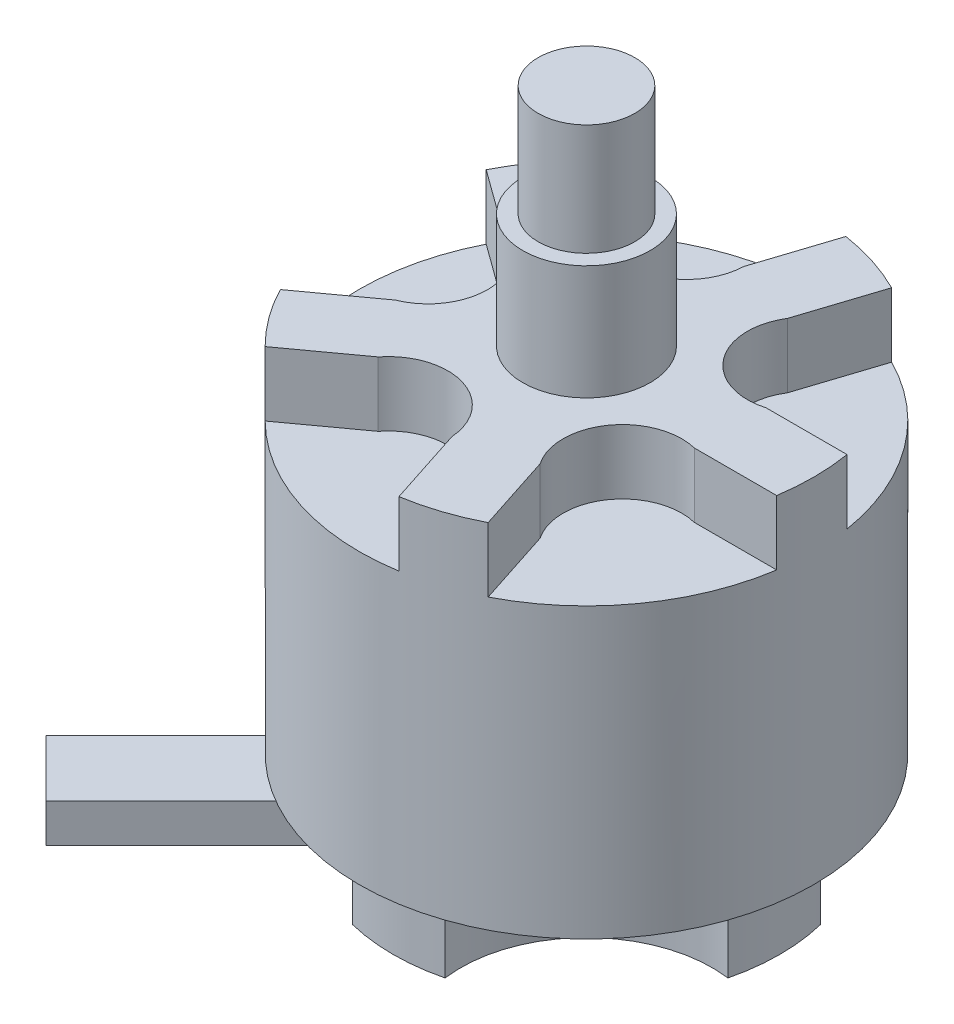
ISO-10303-21;
HEADER;
FILE_DESCRIPTION(('STEP AP214'),'2;1');
FILE_NAME('part.step','',(''),(''),'','','');
FILE_SCHEMA(('AUTOMOTIVE_DESIGN { 1 0 10303 214 1 1 1 1 }'));
ENDSEC;
DATA;
#1=APPLICATION_CONTEXT('core data for automotive mechanical design processes');
#2=APPLICATION_PROTOCOL_DEFINITION('international standard','automotive_design',2000,#1);
#3=PRODUCT_CONTEXT('',#1,'mechanical');
#4=PRODUCT('Part','Part','',(#3));
#5=PRODUCT_RELATED_PRODUCT_CATEGORY('part','',(#4));
#6=PRODUCT_DEFINITION_FORMATION('','',#4);
#7=PRODUCT_DEFINITION_CONTEXT('part definition',#1,'design');
#8=PRODUCT_DEFINITION('design','',#6,#7);
#9=PRODUCT_DEFINITION_SHAPE('','',#8);
#10=(LENGTH_UNIT() NAMED_UNIT(*) SI_UNIT(.MILLI.,.METRE.));
#11=(NAMED_UNIT(*) PLANE_ANGLE_UNIT() SI_UNIT($,.RADIAN.));
#12=(NAMED_UNIT(*) SI_UNIT($,.STERADIAN.) SOLID_ANGLE_UNIT());
#13=UNCERTAINTY_MEASURE_WITH_UNIT(LENGTH_MEASURE(1.E-05),#10,'distance_accuracy_value','');
#14=(GEOMETRIC_REPRESENTATION_CONTEXT(3) GLOBAL_UNCERTAINTY_ASSIGNED_CONTEXT((#13)) GLOBAL_UNIT_ASSIGNED_CONTEXT((#10,
#11,#12)) REPRESENTATION_CONTEXT('',''));
#15=CARTESIAN_POINT('',(0.,0.,0.));
#16=DIRECTION('',(0.,0.,1.));
#17=DIRECTION('',(1.,0.,0.));
#18=AXIS2_PLACEMENT_3D('',#15,#16,#17);
#19=CARTESIAN_POINT('',(0.,-20.,0.));
#20=DIRECTION('',(0.,1.,0.));
#21=DIRECTION('',(0.,0.,1.));
#22=AXIS2_PLACEMENT_3D('',#19,#20,#21);
#23=CYLINDRICAL_SURFACE('',#22,14.1);
#24=CARTESIAN_POINT('',(0.,4.8,0.));
#25=DIRECTION('',(0.,-1.,0.));
#26=DIRECTION('',(0.,0.,-1.));
#27=AXIS2_PLACEMENT_3D('',#24,#25,#26);
#28=CIRCLE('',#27,14.1);
#29=CARTESIAN_POINT('',(0.,4.8,-14.1));
#30=VERTEX_POINT('',#29);
#31=EDGE_CURVE('E458',#30,#30,#28,.T.);
#32=ORIENTED_EDGE('',*,*,#31,.F.);
#33=EDGE_LOOP('',(#32));
#34=FACE_BOUND('',#33,.T.);
#35=CARTESIAN_POINT('',(0.,22.7,0.));
#36=DIRECTION('',(0.,1.,0.));
#37=DIRECTION('',(0.,0.,1.));
#38=AXIS2_PLACEMENT_3D('',#35,#36,#37);
#39=CIRCLE('',#38,14.1000000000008);
#40=CARTESIAN_POINT('',(6.44118393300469,22.7,12.5427728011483));
#41=VERTEX_POINT('',#40);
#42=CARTESIAN_POINT('',(13.937496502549,22.7,2.13452365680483));
#43=VERTEX_POINT('',#42);
#44=EDGE_CURVE('E401',#41,#43,#39,.T.);
#45=ORIENTED_EDGE('',*,*,#44,.F.);
#46=DIRECTION('',(0.,1.,0.));
#47=VECTOR('',#46,1.);
#48=CARTESIAN_POINT('',(6.44118393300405,22.2,12.5427728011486));
#49=LINE('',#48,#47);
#50=CARTESIAN_POINT('',(6.44118393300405,26.7,12.5427728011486));
#51=VERTEX_POINT('',#50);
#52=EDGE_CURVE('E383',#41,#51,#49,.T.);
#53=ORIENTED_EDGE('',*,*,#52,.T.);
#54=CARTESIAN_POINT('',(0.,26.7,0.));
#55=DIRECTION('',(0.,1.,0.));
#56=DIRECTION('',(0.,0.,1.));
#57=AXIS2_PLACEMENT_3D('',#54,#55,#56);
#58=CIRCLE('',#57,14.1);
#59=CARTESIAN_POINT('',(2.2768706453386,26.7,13.9149509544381));
#60=VERTEX_POINT('',#59);
#61=EDGE_CURVE('E553',#60,#51,#58,.T.);
#62=ORIENTED_EDGE('',*,*,#61,.F.);
#63=DIRECTION('',(0.,1.,0.));
#64=VECTOR('',#63,1.);
#65=CARTESIAN_POINT('',(2.2768706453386,22.2,13.9149509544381));
#66=LINE('',#65,#64);
#67=CARTESIAN_POINT('',(2.2768706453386,22.7,13.9149509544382));
#68=VERTEX_POINT('',#67);
#69=EDGE_CURVE('E519',#68,#60,#66,.T.);
#70=ORIENTED_EDGE('',*,*,#69,.F.);
#71=CARTESIAN_POINT('',(0.,22.7,0.));
#72=DIRECTION('',(0.,1.,0.));
#73=DIRECTION('',(0.,0.,1.));
#74=AXIS2_PLACEMENT_3D('',#71,#72,#73);
#75=CIRCLE('',#74,14.1000000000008);
#76=CARTESIAN_POINT('',(-9.93845050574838,22.7,10.0018599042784));
#77=VERTEX_POINT('',#76);
#78=EDGE_CURVE('E420',#77,#68,#75,.T.);
#79=ORIENTED_EDGE('',*,*,#78,.F.);
#80=DIRECTION('',(0.,1.,0.));
#81=VECTOR('',#80,1.);
#82=CARTESIAN_POINT('',(-9.9384505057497,22.2,10.0018599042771));
#83=LINE('',#82,#81);
#84=CARTESIAN_POINT('',(-9.9384505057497,26.7,10.0018599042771));
#85=VERTEX_POINT('',#84);
#86=EDGE_CURVE('E517',#77,#85,#83,.T.);
#87=ORIENTED_EDGE('',*,*,#86,.T.);
#88=CARTESIAN_POINT('',(-12.5303130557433,26.7,6.46538898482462));
#89=VERTEX_POINT('',#88);
#90=EDGE_CURVE('E1212',#89,#85,#58,.T.);
#91=ORIENTED_EDGE('',*,*,#90,.F.);
#92=DIRECTION('',(0.,1.,0.));
#93=VECTOR('',#92,1.);
#94=CARTESIAN_POINT('',(-12.5303130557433,22.2,6.46538898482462));
#95=LINE('',#94,#93);
#96=CARTESIAN_POINT('',(-12.5303130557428,22.7,6.46538898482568));
#97=VERTEX_POINT('',#96);
#98=EDGE_CURVE('E502',#97,#89,#95,.T.);
#99=ORIENTED_EDGE('',*,*,#98,.F.);
#100=CARTESIAN_POINT('',(0.,22.7,0.));
#101=DIRECTION('',(0.,1.,0.));
#102=DIRECTION('',(0.,0.,1.));
#103=AXIS2_PLACEMENT_3D('',#100,#101,#102);
#104=CIRCLE('',#103,14.1000000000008);
#105=CARTESIAN_POINT('',(-12.5834841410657,22.7,-6.36128342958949));
#106=VERTEX_POINT('',#105);
#107=EDGE_CURVE('E432',#106,#97,#104,.T.);
#108=ORIENTED_EDGE('',*,*,#107,.F.);
#109=DIRECTION('',(0.,1.,0.));
#110=VECTOR('',#109,1.);
#111=CARTESIAN_POINT('',(-12.5834841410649,22.2,-6.36128342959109));
#112=LINE('',#111,#110);
#113=CARTESIAN_POINT('',(-12.5834841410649,26.7,-6.36128342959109));
#114=VERTEX_POINT('',#113);
#115=EDGE_CURVE('E500',#106,#114,#112,.T.);
#116=ORIENTED_EDGE('',*,*,#115,.T.);
#117=CARTESIAN_POINT('',(-10.0210300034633,26.7,-9.91912081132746));
#118=VERTEX_POINT('',#117);
#119=EDGE_CURVE('E552',#118,#114,#58,.T.);
#120=ORIENTED_EDGE('',*,*,#119,.F.);
#121=DIRECTION('',(0.,1.,0.));
#122=VECTOR('',#121,1.);
#123=CARTESIAN_POINT('',(-10.0210300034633,22.2,-9.91912081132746));
#124=LINE('',#123,#122);
#125=CARTESIAN_POINT('',(-10.0210300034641,22.7,-9.91912081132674));
#126=VERTEX_POINT('',#125);
#127=EDGE_CURVE('E487',#126,#118,#124,.T.);
#128=ORIENTED_EDGE('',*,*,#127,.F.);
#129=CARTESIAN_POINT('',(0.,22.7,0.));
#130=DIRECTION('',(0.,1.,0.));
#131=DIRECTION('',(0.,0.,1.));
#132=AXIS2_PLACEMENT_3D('',#129,#130,#131);
#133=CIRCLE('',#132,14.1000000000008);
#134=CARTESIAN_POINT('',(2.16142960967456,22.7,-13.9333492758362));
#135=VERTEX_POINT('',#134);
#136=EDGE_CURVE('E435',#135,#126,#133,.T.);
#137=ORIENTED_EDGE('',*,*,#136,.F.);
#138=DIRECTION('',(0.,1.,0.));
#139=VECTOR('',#138,1.);
#140=CARTESIAN_POINT('',(2.16142960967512,22.2,-13.9333492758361));
#141=LINE('',#140,#139);
#142=CARTESIAN_POINT('',(2.16142960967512,26.7,-13.9333492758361));
#143=VERTEX_POINT('',#142);
#144=EDGE_CURVE('E485',#135,#143,#141,.T.);
#145=ORIENTED_EDGE('',*,*,#144,.T.);
#146=CARTESIAN_POINT('',(6.33697591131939,26.7,-12.5957427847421));
#147=VERTEX_POINT('',#146);
#148=EDGE_CURVE('E548',#147,#143,#58,.T.);
#149=ORIENTED_EDGE('',*,*,#148,.F.);
#150=DIRECTION('',(0.,1.,0.));
#151=VECTOR('',#150,1.);
#152=CARTESIAN_POINT('',(6.33697591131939,22.2,-12.5957427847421));
#153=LINE('',#152,#151);
#154=CARTESIAN_POINT('',(6.33697591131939,22.7,-12.5957427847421));
#155=VERTEX_POINT('',#154);
#156=EDGE_CURVE('E543',#155,#147,#153,.T.);
#157=ORIENTED_EDGE('',*,*,#156,.F.);
#158=CARTESIAN_POINT('',(0.,22.7,0.));
#159=DIRECTION('',(0.,1.,0.));
#160=DIRECTION('',(0.,0.,1.));
#161=AXIS2_PLACEMENT_3D('',#158,#159,#160);
#162=CIRCLE('',#161,14.1000000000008);
#163=CARTESIAN_POINT('',(13.919321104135,22.7,-2.25000000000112));
#164=VERTEX_POINT('',#163);
#165=EDGE_CURVE('E446',#164,#155,#162,.T.);
#166=ORIENTED_EDGE('',*,*,#165,.F.);
#167=DIRECTION('',(0.,1.,0.));
#168=VECTOR('',#167,1.);
#169=CARTESIAN_POINT('',(13.919321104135,22.2,-2.25000000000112));
#170=LINE('',#169,#168);
#171=CARTESIAN_POINT('',(13.919321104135,26.7,-2.25000000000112));
#172=VERTEX_POINT('',#171);
#173=EDGE_CURVE('E545',#164,#172,#170,.T.);
#174=ORIENTED_EDGE('',*,*,#173,.T.);
#175=CARTESIAN_POINT('',(13.937496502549,26.7,2.13452365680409));
#176=VERTEX_POINT('',#175);
#177=EDGE_CURVE('E542',#176,#172,#58,.T.);
#178=ORIENTED_EDGE('',*,*,#177,.F.);
#179=DIRECTION('',(0.,1.,0.));
#180=VECTOR('',#179,1.);
#181=CARTESIAN_POINT('',(13.937496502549,22.2,2.13452365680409));
#182=LINE('',#181,#180);
#183=EDGE_CURVE('E395',#43,#176,#182,.T.);
#184=ORIENTED_EDGE('',*,*,#183,.F.);
#185=EDGE_LOOP('',(#45,#53,#62,#70,#79,#87,#91,#99,#108,#116,#120,#128,#137,#145,#149,#157,#166,
#174,#178,#184));
#186=FACE_BOUND('',#185,.T.);
#187=ADVANCED_FACE('F142',(#34,#186),#23,.T.);
#188=CARTESIAN_POINT('',(0.,26.7,0.));
#189=DIRECTION('',(0.,1.,0.));
#190=DIRECTION('',(0.,0.,1.));
#191=AXIS2_PLACEMENT_3D('',#188,#189,#190);
#192=PLANE('',#191);
#193=CARTESIAN_POINT('',(0.,26.7,0.));
#194=DIRECTION('',(0.,1.,0.));
#195=DIRECTION('',(0.,0.,1.));
#196=AXIS2_PLACEMENT_3D('',#193,#194,#195);
#197=CIRCLE('',#196,3.95);
#198=CARTESIAN_POINT('',(0.,26.7,3.95));
#199=VERTEX_POINT('',#198);
#200=EDGE_CURVE('E757',#199,#199,#197,.T.);
#201=ORIENTED_EDGE('',*,*,#200,.F.);
#202=EDGE_LOOP('',(#201));
#203=FACE_BOUND('',#202,.T.);
#204=CARTESIAN_POINT('',(7.93678185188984,26.7,5.70537007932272));
#205=DIRECTION('',(0.,1.,0.));
#206=DIRECTION('',(0.,0.,1.));
#207=AXIS2_PLACEMENT_3D('',#204,#205,#206);
#208=CIRCLE('',#207,3.67931056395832);
#209=CARTESIAN_POINT('',(8.82356370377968,26.7,2.13452365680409));
#210=VERTEX_POINT('',#209);
#211=CARTESIAN_POINT('',(4.88955100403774,26.7,7.76733767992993));
#212=VERTEX_POINT('',#211);
#213=EDGE_CURVE('E476',#210,#212,#208,.T.);
#214=ORIENTED_EDGE('',*,*,#213,.F.);
#215=DIRECTION('',(1.,0.,0.));
#216=VECTOR('',#215,1.);
#217=CARTESIAN_POINT('',(8.82356370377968,26.7,2.13452365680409));
#218=LINE('',#217,#216);
#219=EDGE_CURVE('E479',#210,#176,#218,.T.);
#220=ORIENTED_EDGE('',*,*,#219,.T.);
#221=ORIENTED_EDGE('',*,*,#177,.T.);
#222=DIRECTION('',(1.,0.,0.));
#223=VECTOR('',#222,1.);
#224=CARTESIAN_POINT('',(8.89813146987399,26.7,-2.25000000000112));
#225=LINE('',#224,#223);
#226=CARTESIAN_POINT('',(8.89813146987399,26.7,-2.25000000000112));
#227=VERTEX_POINT('',#226);
#228=EDGE_CURVE('E533',#227,#172,#225,.T.);
#229=ORIENTED_EDGE('',*,*,#228,.F.);
#230=CARTESIAN_POINT('',(7.87872986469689,26.7,-5.78527178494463));
#231=DIRECTION('',(0.,1.,0.));
#232=DIRECTION('',(0.,0.,1.));
#233=AXIS2_PLACEMENT_3D('',#230,#231,#232);
#234=CIRCLE('',#233,3.67931056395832);
#235=CARTESIAN_POINT('',(4.75668376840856,26.7,-7.73210367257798));
#236=VERTEX_POINT('',#235);
#237=EDGE_CURVE('E530',#236,#227,#234,.T.);
#238=ORIENTED_EDGE('',*,*,#237,.F.);
#239=DIRECTION('',(0.309016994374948,0.,-0.951056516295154));
#240=VECTOR('',#239,1.);
#241=CARTESIAN_POINT('',(4.75668376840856,26.7,-7.73210367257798));
#242=LINE('',#241,#240);
#243=EDGE_CURVE('E536',#236,#147,#242,.T.);
#244=ORIENTED_EDGE('',*,*,#243,.T.);
#245=ORIENTED_EDGE('',*,*,#148,.T.);
#246=DIRECTION('',(0.309016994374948,0.,-0.951056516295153));
#247=VECTOR('',#246,1.);
#248=CARTESIAN_POINT('',(0.609796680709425,26.7,-9.15791415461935));
#249=LINE('',#248,#247);
#250=CARTESIAN_POINT('',(0.609796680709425,26.7,-9.15791415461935));
#251=VERTEX_POINT('',#250);
#252=EDGE_CURVE('E492',#251,#143,#249,.T.);
#253=ORIENTED_EDGE('',*,*,#252,.F.);
#254=CARTESIAN_POINT('',(-3.06745900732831,26.7,-9.28086467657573));
#255=DIRECTION('',(0.,1.,0.));
#256=DIRECTION('',(0.,0.,1.));
#257=AXIS2_PLACEMENT_3D('',#254,#255,#256);
#258=CIRCLE('',#257,3.67931056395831);
#259=CARTESIAN_POINT('',(-5.88377146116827,26.7,-6.91322653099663));
#260=VERTEX_POINT('',#259);
#261=EDGE_CURVE('E494',#260,#251,#258,.T.);
#262=ORIENTED_EDGE('',*,*,#261,.F.);
#263=DIRECTION('',(-0.809016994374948,0.,-0.587785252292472));
#264=VECTOR('',#263,1.);
#265=CARTESIAN_POINT('',(-5.88377146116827,26.7,-6.91322653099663));
#266=LINE('',#265,#264);
#267=EDGE_CURVE('E484',#260,#118,#266,.T.);
#268=ORIENTED_EDGE('',*,*,#267,.T.);
#269=ORIENTED_EDGE('',*,*,#119,.T.);
#270=DIRECTION('',(-0.809016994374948,0.,-0.587785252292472));
#271=VECTOR('',#270,1.);
#272=CARTESIAN_POINT('',(-8.52125639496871,26.7,-3.40990221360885));
#273=LINE('',#272,#271);
#274=CARTESIAN_POINT('',(-8.52125639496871,26.7,-3.40990221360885));
#275=VERTEX_POINT('',#274);
#276=EDGE_CURVE('E507',#275,#114,#273,.T.);
#277=ORIENTED_EDGE('',*,*,#276,.F.);
#278=CARTESIAN_POINT('',(-9.77452379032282,26.7,0.0493819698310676));
#279=DIRECTION('',(0.,1.,0.));
#280=DIRECTION('',(0.,0.,1.));
#281=AXIS2_PLACEMENT_3D('',#278,#279,#280);
#282=CIRCLE('',#281,3.67931056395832);
#283=CARTESIAN_POINT('',(-8.39305451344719,26.7,3.45949470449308));
#284=VERTEX_POINT('',#283);
#285=EDGE_CURVE('E510',#284,#275,#282,.T.);
#286=ORIENTED_EDGE('',*,*,#285,.F.);
#287=DIRECTION('',(-0.809016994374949,0.,0.587785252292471));
#288=VECTOR('',#287,1.);
#289=CARTESIAN_POINT('',(-8.39305451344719,26.7,3.45949470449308));
#290=LINE('',#289,#288);
#291=EDGE_CURVE('E499',#284,#89,#290,.T.);
#292=ORIENTED_EDGE('',*,*,#291,.T.);
#293=ORIENTED_EDGE('',*,*,#90,.T.);
#294=DIRECTION('',(-0.809016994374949,0.,0.587785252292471));
#295=VECTOR('',#294,1.);
#296=CARTESIAN_POINT('',(-5.8762227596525,26.7,7.05047868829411));
#297=LINE('',#296,#295);
#298=CARTESIAN_POINT('',(-5.8762227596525,26.7,7.05047868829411));
#299=VERTEX_POINT('',#298);
#300=EDGE_CURVE('E524',#299,#85,#297,.T.);
#301=ORIENTED_EDGE('',*,*,#300,.F.);
#302=CARTESIAN_POINT('',(-2.97352891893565,26.7,9.31138441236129));
#303=DIRECTION('',(0.,1.,0.));
#304=DIRECTION('',(0.,0.,1.));
#305=AXIS2_PLACEMENT_3D('',#302,#303,#304);
#306=CIRCLE('',#305,3.67931056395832);
#307=CARTESIAN_POINT('',(0.696578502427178,26.7,9.05131184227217));
#308=VERTEX_POINT('',#307);
#309=EDGE_CURVE('E527',#308,#299,#306,.T.);
#310=ORIENTED_EDGE('',*,*,#309,.F.);
#311=DIRECTION('',(0.309016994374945,0.,0.951056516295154));
#312=VECTOR('',#311,1.);
#313=CARTESIAN_POINT('',(0.696578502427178,26.7,9.05131184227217));
#314=LINE('',#313,#312);
#315=EDGE_CURVE('E516',#308,#60,#314,.T.);
#316=ORIENTED_EDGE('',*,*,#315,.T.);
#317=ORIENTED_EDGE('',*,*,#61,.T.);
#318=DIRECTION('',(0.309016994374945,0.,0.951056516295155));
#319=VECTOR('',#318,1.);
#320=CARTESIAN_POINT('',(4.88955100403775,26.7,7.76733767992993));
#321=LINE('',#320,#319);
#322=EDGE_CURVE('E389',#212,#51,#321,.T.);
#323=ORIENTED_EDGE('',*,*,#322,.F.);
#324=EDGE_LOOP('',(#214,#220,#221,#229,#238,#244,#245,#253,#262,#268,#269,#277,#286,#292,#293,
#301,#310,#316,#317,#323));
#325=FACE_BOUND('',#324,.T.);
#326=ADVANCED_FACE('F702',(#203,#325),#192,.T.);
#327=CARTESIAN_POINT('',(0.,40.7,0.));
#328=DIRECTION('',(0.,1.,0.));
#329=DIRECTION('',(0.,0.,1.));
#330=AXIS2_PLACEMENT_3D('',#327,#328,#329);
#331=PLANE('',#330);
#332=CARTESIAN_POINT('',(0.,40.7,0.));
#333=DIRECTION('',(0.,1.,0.));
#334=DIRECTION('',(0.,0.,1.));
#335=AXIS2_PLACEMENT_3D('',#332,#333,#334);
#336=CIRCLE('',#335,3.);
#337=CARTESIAN_POINT('',(0.,40.7,3.));
#338=VERTEX_POINT('',#337);
#339=EDGE_CURVE('E770',#338,#338,#336,.T.);
#340=ORIENTED_EDGE('',*,*,#339,.T.);
#341=EDGE_LOOP('',(#340));
#342=FACE_BOUND('',#341,.T.);
#343=ADVANCED_FACE('F708',(#342),#331,.T.);
#344=CARTESIAN_POINT('',(0.,33.8,0.));
#345=DIRECTION('',(0.,1.,0.));
#346=DIRECTION('',(0.,0.,1.));
#347=AXIS2_PLACEMENT_3D('',#344,#345,#346);
#348=CYLINDRICAL_SURFACE('',#347,3.);
#349=CARTESIAN_POINT('',(0.,33.8,0.));
#350=DIRECTION('',(0.,1.,0.));
#351=DIRECTION('',(0.,0.,1.));
#352=AXIS2_PLACEMENT_3D('',#349,#350,#351);
#353=CIRCLE('',#352,3.);
#354=CARTESIAN_POINT('',(0.,33.8,3.));
#355=VERTEX_POINT('',#354);
#356=EDGE_CURVE('E762',#355,#355,#353,.T.);
#357=CARTESIAN_POINT('',(0.,33.8,3.));
#358=CARTESIAN_POINT('',(0.,33.871875,3.));
#359=CARTESIAN_POINT('',(0.,33.94375,3.));
#360=CARTESIAN_POINT('',(0.,34.0875,3.));
#361=CARTESIAN_POINT('',(0.,34.159375,3.));
#362=CARTESIAN_POINT('',(0.,34.303125,3.));
#363=CARTESIAN_POINT('',(0.,34.375,3.));
#364=CARTESIAN_POINT('',(0.,34.51875,3.));
#365=CARTESIAN_POINT('',(0.,34.590625,3.));
#366=CARTESIAN_POINT('',(0.,34.734375,3.));
#367=CARTESIAN_POINT('',(0.,34.80625,3.));
#368=CARTESIAN_POINT('',(0.,34.95,3.));
#369=CARTESIAN_POINT('',(0.,35.021875,3.));
#370=CARTESIAN_POINT('',(0.,35.165625,3.));
#371=CARTESIAN_POINT('',(0.,35.2375,3.));
#372=CARTESIAN_POINT('',(0.,35.38125,3.));
#373=CARTESIAN_POINT('',(0.,35.453125,3.));
#374=CARTESIAN_POINT('',(0.,35.596875,3.));
#375=CARTESIAN_POINT('',(0.,35.66875,3.));
#376=CARTESIAN_POINT('',(0.,35.8125,3.));
#377=CARTESIAN_POINT('',(0.,35.884375,3.));
#378=CARTESIAN_POINT('',(0.,36.028125,3.));
#379=CARTESIAN_POINT('',(0.,36.1,3.));
#380=CARTESIAN_POINT('',(0.,36.24375,3.));
#381=CARTESIAN_POINT('',(0.,36.315625,3.));
#382=CARTESIAN_POINT('',(0.,36.459375,3.));
#383=CARTESIAN_POINT('',(0.,36.53125,3.));
#384=CARTESIAN_POINT('',(0.,36.675,3.));
#385=CARTESIAN_POINT('',(0.,36.746875,3.));
#386=CARTESIAN_POINT('',(0.,36.890625,3.));
#387=CARTESIAN_POINT('',(0.,36.9625,3.));
#388=CARTESIAN_POINT('',(0.,37.10625,3.));
#389=CARTESIAN_POINT('',(0.,37.178125,3.));
#390=CARTESIAN_POINT('',(0.,37.321875,3.));
#391=CARTESIAN_POINT('',(0.,37.39375,3.));
#392=CARTESIAN_POINT('',(0.,37.5375,3.));
#393=CARTESIAN_POINT('',(0.,37.609375,3.));
#394=CARTESIAN_POINT('',(0.,37.753125,3.));
#395=CARTESIAN_POINT('',(0.,37.825,3.));
#396=CARTESIAN_POINT('',(0.,37.96875,3.));
#397=CARTESIAN_POINT('',(0.,38.040625,3.));
#398=CARTESIAN_POINT('',(0.,38.184375,3.));
#399=CARTESIAN_POINT('',(0.,38.25625,3.));
#400=CARTESIAN_POINT('',(0.,38.4,3.));
#401=CARTESIAN_POINT('',(0.,38.471875,3.));
#402=CARTESIAN_POINT('',(0.,38.615625,3.));
#403=CARTESIAN_POINT('',(0.,38.6875,3.));
#404=CARTESIAN_POINT('',(0.,38.83125,3.));
#405=CARTESIAN_POINT('',(0.,38.903125,3.));
#406=CARTESIAN_POINT('',(0.,39.046875,3.));
#407=CARTESIAN_POINT('',(0.,39.11875,3.));
#408=CARTESIAN_POINT('',(0.,39.2625,3.));
#409=CARTESIAN_POINT('',(0.,39.334375,3.));
#410=CARTESIAN_POINT('',(0.,39.478125,3.));
#411=CARTESIAN_POINT('',(0.,39.55,3.));
#412=CARTESIAN_POINT('',(0.,39.69375,3.));
#413=CARTESIAN_POINT('',(0.,39.765625,3.));
#414=CARTESIAN_POINT('',(0.,39.909375,3.));
#415=CARTESIAN_POINT('',(0.,39.98125,3.));
#416=CARTESIAN_POINT('',(0.,40.125,3.));
#417=CARTESIAN_POINT('',(0.,40.196875,3.));
#418=CARTESIAN_POINT('',(0.,40.340625,3.));
#419=CARTESIAN_POINT('',(0.,40.4125,3.));
#420=CARTESIAN_POINT('',(0.,40.55625,3.));
#421=CARTESIAN_POINT('',(0.,40.628125,3.));
#422=CARTESIAN_POINT('',(0.,40.7,3.));
#423=B_SPLINE_CURVE_WITH_KNOTS('',3,(#357,#358,#359,#360,#361,#362,#363,#364,#365,#366,#367,
#368,#369,#370,#371,#372,#373,#374,#375,#376,#377,#378,#379,#380,#381,#382,#383,#384,#385,#386,
#387,#388,#389,#390,#391,#392,#393,#394,#395,#396,#397,#398,#399,#400,#401,#402,#403,#404,#405,
#406,#407,#408,#409,#410,#411,#412,#413,#414,#415,#416,#417,#418,#419,#420,#421,#422),
.UNSPECIFIED.,.F.,.F.,(4,2,2,2,2,2,2,2,2,2,2,2,2,2,2,2,2,2,2,2,2,2,2,2,2,2,2,2,2,2,2,2,4),(0.,
0.215624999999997,0.431249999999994,0.646874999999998,0.862499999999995,1.078125,1.29375,
1.509375,1.725,1.94062499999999,2.15625,2.371875,2.5875,2.803125,3.01875,3.234375,
3.44999999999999,3.665625,3.88125,4.096875,4.3125,4.528125,4.74375,4.959375,5.175,5.390625,
5.60625,5.821875,6.0375,6.253125,6.46875,6.684375,6.9),.UNSPECIFIED.);
#424=EDGE_CURVE('BSEAM859',#355,#338,#423,.T.);
#425=ORIENTED_EDGE('',*,*,#356,.T.);
#426=ORIENTED_EDGE('',*,*,#339,.F.);
#427=ORIENTED_EDGE('',*,*,#424,.T.);
#428=ORIENTED_EDGE('',*,*,#424,.F.);
#429=EDGE_LOOP('',(#425,#427,#426,#428));
#430=FACE_BOUND('',#429,.T.);
#431=ADVANCED_FACE('F859',(#430),#348,.T.);
#432=CARTESIAN_POINT('',(0.,33.8,0.));
#433=DIRECTION('',(0.,1.,0.));
#434=DIRECTION('',(0.,0.,1.));
#435=AXIS2_PLACEMENT_3D('',#432,#433,#434);
#436=PLANE('',#435);
#437=CARTESIAN_POINT('',(0.,33.8,0.));
#438=DIRECTION('',(0.,1.,0.));
#439=DIRECTION('',(0.,0.,1.));
#440=AXIS2_PLACEMENT_3D('',#437,#438,#439);
#441=CIRCLE('',#440,3.95);
#442=CARTESIAN_POINT('',(0.,33.8,3.95));
#443=VERTEX_POINT('',#442);
#444=EDGE_CURVE('E759',#443,#443,#441,.F.);
#445=ORIENTED_EDGE('',*,*,#444,.F.);
#446=EDGE_LOOP('',(#445));
#447=FACE_BOUND('',#446,.T.);
#448=ORIENTED_EDGE('',*,*,#356,.F.);
#449=EDGE_LOOP('',(#448));
#450=FACE_BOUND('',#449,.T.);
#451=ADVANCED_FACE('F863',(#447,#450),#436,.T.);
#452=CARTESIAN_POINT('',(0.,26.3,0.));
#453=DIRECTION('',(0.,1.,0.));
#454=DIRECTION('',(0.,0.,1.));
#455=AXIS2_PLACEMENT_3D('',#452,#453,#454);
#456=CYLINDRICAL_SURFACE('',#455,3.95);
#457=CARTESIAN_POINT('',(0.,26.7,3.95));
#458=CARTESIAN_POINT('',(0.,26.7739583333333,3.95));
#459=CARTESIAN_POINT('',(0.,26.8479166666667,3.95));
#460=CARTESIAN_POINT('',(0.,26.9958333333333,3.95));
#461=CARTESIAN_POINT('',(0.,27.0697916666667,3.95));
#462=CARTESIAN_POINT('',(0.,27.2177083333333,3.95));
#463=CARTESIAN_POINT('',(0.,27.2916666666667,3.95));
#464=CARTESIAN_POINT('',(0.,27.4395833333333,3.95));
#465=CARTESIAN_POINT('',(0.,27.5135416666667,3.95));
#466=CARTESIAN_POINT('',(0.,27.6614583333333,3.95));
#467=CARTESIAN_POINT('',(0.,27.7354166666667,3.95));
#468=CARTESIAN_POINT('',(0.,27.8833333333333,3.95));
#469=CARTESIAN_POINT('',(0.,27.9572916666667,3.95));
#470=CARTESIAN_POINT('',(0.,28.1052083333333,3.95));
#471=CARTESIAN_POINT('',(0.,28.1791666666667,3.95));
#472=CARTESIAN_POINT('',(0.,28.3270833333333,3.95));
#473=CARTESIAN_POINT('',(0.,28.4010416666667,3.95));
#474=CARTESIAN_POINT('',(0.,28.5489583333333,3.95));
#475=CARTESIAN_POINT('',(0.,28.6229166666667,3.95));
#476=CARTESIAN_POINT('',(0.,28.7708333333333,3.95));
#477=CARTESIAN_POINT('',(0.,28.8447916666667,3.95));
#478=CARTESIAN_POINT('',(0.,28.9927083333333,3.95));
#479=CARTESIAN_POINT('',(0.,29.0666666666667,3.95));
#480=CARTESIAN_POINT('',(0.,29.2145833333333,3.95));
#481=CARTESIAN_POINT('',(0.,29.2885416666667,3.95));
#482=CARTESIAN_POINT('',(0.,29.4364583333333,3.95));
#483=CARTESIAN_POINT('',(0.,29.5104166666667,3.95));
#484=CARTESIAN_POINT('',(0.,29.6583333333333,3.95));
#485=CARTESIAN_POINT('',(0.,29.7322916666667,3.95));
#486=CARTESIAN_POINT('',(0.,29.8802083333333,3.95));
#487=CARTESIAN_POINT('',(0.,29.9541666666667,3.95));
#488=CARTESIAN_POINT('',(0.,30.1020833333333,3.95));
#489=CARTESIAN_POINT('',(0.,30.1760416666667,3.95));
#490=CARTESIAN_POINT('',(0.,30.3239583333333,3.95));
#491=CARTESIAN_POINT('',(0.,30.3979166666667,3.95));
#492=CARTESIAN_POINT('',(0.,30.5458333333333,3.95));
#493=CARTESIAN_POINT('',(0.,30.6197916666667,3.95));
#494=CARTESIAN_POINT('',(0.,30.7677083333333,3.95));
#495=CARTESIAN_POINT('',(0.,30.8416666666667,3.95));
#496=CARTESIAN_POINT('',(0.,30.9895833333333,3.95));
#497=CARTESIAN_POINT('',(0.,31.0635416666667,3.95));
#498=CARTESIAN_POINT('',(0.,31.2114583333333,3.95));
#499=CARTESIAN_POINT('',(0.,31.2854166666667,3.95));
#500=CARTESIAN_POINT('',(0.,31.4333333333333,3.95));
#501=CARTESIAN_POINT('',(0.,31.5072916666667,3.95));
#502=CARTESIAN_POINT('',(0.,31.6552083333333,3.95));
#503=CARTESIAN_POINT('',(0.,31.7291666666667,3.95));
#504=CARTESIAN_POINT('',(0.,31.8770833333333,3.95));
#505=CARTESIAN_POINT('',(0.,31.9510416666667,3.95));
#506=CARTESIAN_POINT('',(0.,32.0989583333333,3.95));
#507=CARTESIAN_POINT('',(0.,32.1729166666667,3.95));
#508=CARTESIAN_POINT('',(0.,32.3208333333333,3.95));
#509=CARTESIAN_POINT('',(0.,32.3947916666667,3.95));
#510=CARTESIAN_POINT('',(0.,32.5427083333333,3.95));
#511=CARTESIAN_POINT('',(0.,32.6166666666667,3.95));
#512=CARTESIAN_POINT('',(0.,32.7645833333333,3.95));
#513=CARTESIAN_POINT('',(0.,32.8385416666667,3.95));
#514=CARTESIAN_POINT('',(0.,32.9864583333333,3.95));
#515=CARTESIAN_POINT('',(0.,33.0604166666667,3.95));
#516=CARTESIAN_POINT('',(0.,33.2083333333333,3.95));
#517=CARTESIAN_POINT('',(0.,33.2822916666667,3.95));
#518=CARTESIAN_POINT('',(0.,33.4302083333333,3.95));
#519=CARTESIAN_POINT('',(0.,33.5041666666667,3.95));
#520=CARTESIAN_POINT('',(0.,33.6520833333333,3.95));
#521=CARTESIAN_POINT('',(0.,33.7260416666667,3.95));
#522=CARTESIAN_POINT('',(0.,33.8,3.95));
#523=B_SPLINE_CURVE_WITH_KNOTS('',3,(#457,#458,#459,#460,#461,#462,#463,#464,#465,#466,#467,
#468,#469,#470,#471,#472,#473,#474,#475,#476,#477,#478,#479,#480,#481,#482,#483,#484,#485,#486,
#487,#488,#489,#490,#491,#492,#493,#494,#495,#496,#497,#498,#499,#500,#501,#502,#503,#504,#505,
#506,#507,#508,#509,#510,#511,#512,#513,#514,#515,#516,#517,#518,#519,#520,#521,#522),
.UNSPECIFIED.,.F.,.F.,(4,2,2,2,2,2,2,2,2,2,2,2,2,2,2,2,2,2,2,2,2,2,2,2,2,2,2,2,2,2,2,2,4),(0.,
0.221875,0.44375,0.665625,0.887499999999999,1.109375,1.33125,1.553125,1.775,1.996875,2.21875,
2.440625,2.6625,2.884375,3.10625,3.328125,3.55,3.771875,3.99375,4.215625,4.4375,4.659375,
4.88124999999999,5.103125,5.32499999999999,5.546875,5.76874999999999,5.990625,6.21249999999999,
6.434375,6.65624999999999,6.878125,7.09999999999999),.UNSPECIFIED.);
#524=EDGE_CURVE('BSEAM866',#199,#443,#523,.T.);
#525=ORIENTED_EDGE('',*,*,#200,.T.);
#526=ORIENTED_EDGE('',*,*,#444,.T.);
#527=ORIENTED_EDGE('',*,*,#524,.T.);
#528=ORIENTED_EDGE('',*,*,#524,.F.);
#529=EDGE_LOOP('',(#525,#527,#526,#528));
#530=FACE_BOUND('',#529,.T.);
#531=ADVANCED_FACE('F866',(#530),#456,.T.);
#532=CARTESIAN_POINT('',(7.87872986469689,22.2,-5.78527178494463));
#533=DIRECTION('',(0.,1.,0.));
#534=DIRECTION('',(0.,0.,1.));
#535=AXIS2_PLACEMENT_3D('',#532,#533,#534);
#536=CYLINDRICAL_SURFACE('',#535,3.67931056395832);
#537=DIRECTION('',(0.,1.,0.));
#538=VECTOR('',#537,1.);
#539=CARTESIAN_POINT('',(8.89813146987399,22.2,-2.25000000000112));
#540=LINE('',#539,#538);
#541=CARTESIAN_POINT('',(8.89813146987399,22.7,-2.25000000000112));
#542=VERTEX_POINT('',#541);
#543=EDGE_CURVE('E539',#542,#227,#540,.T.);
#544=ORIENTED_EDGE('',*,*,#543,.F.);
#545=CARTESIAN_POINT('',(7.87872986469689,22.7,-5.78527178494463));
#546=DIRECTION('',(0.,1.,0.));
#547=DIRECTION('',(0.,0.,1.));
#548=AXIS2_PLACEMENT_3D('',#545,#546,#547);
#549=CIRCLE('',#548,3.67931056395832);
#550=CARTESIAN_POINT('',(4.75668376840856,22.7,-7.73210367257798));
#551=VERTEX_POINT('',#550);
#552=EDGE_CURVE('E452',#551,#542,#549,.T.);
#553=ORIENTED_EDGE('',*,*,#552,.F.);
#554=DIRECTION('',(0.,1.,0.));
#555=VECTOR('',#554,1.);
#556=CARTESIAN_POINT('',(4.75668376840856,22.2,-7.73210367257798));
#557=LINE('',#556,#555);
#558=EDGE_CURVE('E540',#551,#236,#557,.T.);
#559=ORIENTED_EDGE('',*,*,#558,.T.);
#560=ORIENTED_EDGE('',*,*,#237,.T.);
#561=EDGE_LOOP('',(#544,#553,#559,#560));
#562=FACE_BOUND('',#561,.T.);
#563=ADVANCED_FACE('F872',(#562),#536,.F.);
#564=CARTESIAN_POINT('',(4.75668376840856,22.2,-7.73210367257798));
#565=DIRECTION('',(0.951056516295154,0.,0.309016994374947));
#566=DIRECTION('',(0.309016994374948,0.,-0.951056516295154));
#567=AXIS2_PLACEMENT_3D('',#564,#565,#566);
#568=PLANE('',#567);
#569=ORIENTED_EDGE('',*,*,#558,.F.);
#570=DIRECTION('',(-0.309016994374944,0.,0.951056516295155));
#571=VECTOR('',#570,1.);
#572=CARTESIAN_POINT('',(6.33697591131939,22.7,-12.5957427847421));
#573=LINE('',#572,#571);
#574=EDGE_CURVE('E449',#155,#551,#573,.T.);
#575=ORIENTED_EDGE('',*,*,#574,.F.);
#576=ORIENTED_EDGE('',*,*,#156,.T.);
#577=ORIENTED_EDGE('',*,*,#243,.F.);
#578=EDGE_LOOP('',(#569,#575,#576,#577));
#579=FACE_BOUND('',#578,.T.);
#580=ADVANCED_FACE('F877',(#579),#568,.T.);
#581=CARTESIAN_POINT('',(8.89813146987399,22.2,-2.25000000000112));
#582=DIRECTION('',(0.,0.,1.));
#583=DIRECTION('',(1.,0.,0.));
#584=AXIS2_PLACEMENT_3D('',#581,#582,#583);
#585=PLANE('',#584);
#586=ORIENTED_EDGE('',*,*,#173,.F.);
#587=DIRECTION('',(-1.,0.,0.));
#588=VECTOR('',#587,1.);
#589=CARTESIAN_POINT('',(13.919321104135,22.7,-2.25000000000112));
#590=LINE('',#589,#588);
#591=EDGE_CURVE('E455',#164,#542,#590,.T.);
#592=ORIENTED_EDGE('',*,*,#591,.T.);
#593=ORIENTED_EDGE('',*,*,#543,.T.);
#594=ORIENTED_EDGE('',*,*,#228,.T.);
#595=EDGE_LOOP('',(#586,#592,#593,#594));
#596=FACE_BOUND('',#595,.T.);
#597=ADVANCED_FACE('F926',(#596),#585,.F.);
#598=CARTESIAN_POINT('',(-2.97352891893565,22.2,9.31138441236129));
#599=DIRECTION('',(0.,1.,0.));
#600=DIRECTION('',(0.,0.,1.));
#601=AXIS2_PLACEMENT_3D('',#598,#599,#600);
#602=CYLINDRICAL_SURFACE('',#601,3.67931056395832);
#603=DIRECTION('',(0.,1.,0.));
#604=VECTOR('',#603,1.);
#605=CARTESIAN_POINT('',(-5.8762227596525,22.2,7.05047868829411));
#606=LINE('',#605,#604);
#607=CARTESIAN_POINT('',(-5.87622275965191,22.7,7.05047868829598));
#608=VERTEX_POINT('',#607);
#609=EDGE_CURVE('E514',#608,#299,#606,.T.);
#610=ORIENTED_EDGE('',*,*,#609,.F.);
#611=CARTESIAN_POINT('',(-2.97352891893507,22.7,9.31138441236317));
#612=DIRECTION('',(0.,1.,0.));
#613=DIRECTION('',(0.,0.,1.));
#614=AXIS2_PLACEMENT_3D('',#611,#612,#613);
#615=CIRCLE('',#614,3.67931056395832);
#616=CARTESIAN_POINT('',(0.696578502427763,22.7,9.05131184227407));
#617=VERTEX_POINT('',#616);
#618=EDGE_CURVE('E410',#617,#608,#615,.T.);
#619=ORIENTED_EDGE('',*,*,#618,.F.);
#620=DIRECTION('',(0.,1.,0.));
#621=VECTOR('',#620,1.);
#622=CARTESIAN_POINT('',(0.696578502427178,22.2,9.05131184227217));
#623=LINE('',#622,#621);
#624=EDGE_CURVE('E513',#617,#308,#623,.T.);
#625=ORIENTED_EDGE('',*,*,#624,.T.);
#626=ORIENTED_EDGE('',*,*,#309,.T.);
#627=EDGE_LOOP('',(#610,#619,#625,#626));
#628=FACE_BOUND('',#627,.T.);
#629=ADVANCED_FACE('F922',(#628),#602,.F.);
#630=CARTESIAN_POINT('',(0.696578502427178,22.2,9.05131184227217));
#631=DIRECTION('',(-0.951056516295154,0.,0.309016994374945));
#632=DIRECTION('',(0.309016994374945,0.,0.951056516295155));
#633=AXIS2_PLACEMENT_3D('',#630,#631,#632);
#634=PLANE('',#633);
#635=ORIENTED_EDGE('',*,*,#624,.F.);
#636=DIRECTION('',(-0.309016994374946,0.,-0.951056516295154));
#637=VECTOR('',#636,1.);
#638=CARTESIAN_POINT('',(2.2768706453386,22.7,13.9149509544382));
#639=LINE('',#638,#637);
#640=EDGE_CURVE('E417',#68,#617,#639,.T.);
#641=ORIENTED_EDGE('',*,*,#640,.F.);
#642=ORIENTED_EDGE('',*,*,#69,.T.);
#643=ORIENTED_EDGE('',*,*,#315,.F.);
#644=EDGE_LOOP('',(#635,#641,#642,#643));
#645=FACE_BOUND('',#644,.T.);
#646=ADVANCED_FACE('F925',(#645),#634,.T.);
#647=CARTESIAN_POINT('',(-5.8762227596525,22.2,7.05047868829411));
#648=DIRECTION('',(-0.587785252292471,0.,-0.809016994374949));
#649=DIRECTION('',(-0.809016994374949,0.,0.587785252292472));
#650=AXIS2_PLACEMENT_3D('',#647,#648,#649);
#651=PLANE('',#650);
#652=ORIENTED_EDGE('',*,*,#86,.F.);
#653=DIRECTION('',(0.809016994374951,0.,-0.587785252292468));
#654=VECTOR('',#653,1.);
#655=CARTESIAN_POINT('',(-9.93845050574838,22.7,10.0018599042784));
#656=LINE('',#655,#654);
#657=EDGE_CURVE('E406',#77,#608,#656,.T.);
#658=ORIENTED_EDGE('',*,*,#657,.T.);
#659=ORIENTED_EDGE('',*,*,#609,.T.);
#660=ORIENTED_EDGE('',*,*,#300,.T.);
#661=EDGE_LOOP('',(#652,#658,#659,#660));
#662=FACE_BOUND('',#661,.T.);
#663=ADVANCED_FACE('F914',(#662),#651,.F.);
#664=CARTESIAN_POINT('',(-9.77452379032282,22.2,0.0493819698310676));
#665=DIRECTION('',(0.,1.,0.));
#666=DIRECTION('',(0.,0.,1.));
#667=AXIS2_PLACEMENT_3D('',#664,#665,#666);
#668=CYLINDRICAL_SURFACE('',#667,3.67931056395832);
#669=DIRECTION('',(0.,1.,0.));
#670=VECTOR('',#669,1.);
#671=CARTESIAN_POINT('',(-8.52125639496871,22.2,-3.40990221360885));
#672=LINE('',#671,#670);
#673=CARTESIAN_POINT('',(-8.52125639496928,22.7,-3.40990221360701));
#674=VERTEX_POINT('',#673);
#675=EDGE_CURVE('E497',#674,#275,#672,.T.);
#676=ORIENTED_EDGE('',*,*,#675,.F.);
#677=CARTESIAN_POINT('',(-9.77452379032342,22.7,0.0493819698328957));
#678=DIRECTION('',(0.,1.,0.));
#679=DIRECTION('',(0.,0.,1.));
#680=AXIS2_PLACEMENT_3D('',#677,#678,#679);
#681=CIRCLE('',#680,3.67931056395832);
#682=CARTESIAN_POINT('',(-8.39305451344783,22.7,3.45949470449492));
#683=VERTEX_POINT('',#682);
#684=EDGE_CURVE('E426',#683,#674,#681,.T.);
#685=ORIENTED_EDGE('',*,*,#684,.F.);
#686=DIRECTION('',(0.,1.,0.));
#687=VECTOR('',#686,1.);
#688=CARTESIAN_POINT('',(-8.39305451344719,22.2,3.45949470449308));
#689=LINE('',#688,#687);
#690=EDGE_CURVE('E496',#683,#284,#689,.T.);
#691=ORIENTED_EDGE('',*,*,#690,.T.);
#692=ORIENTED_EDGE('',*,*,#285,.T.);
#693=EDGE_LOOP('',(#676,#685,#691,#692));
#694=FACE_BOUND('',#693,.T.);
#695=ADVANCED_FACE('F910',(#694),#668,.F.);
#696=CARTESIAN_POINT('',(-8.39305451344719,22.2,3.45949470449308));
#697=DIRECTION('',(-0.587785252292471,0.,-0.809016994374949));
#698=DIRECTION('',(-0.809016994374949,0.,0.587785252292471));
#699=AXIS2_PLACEMENT_3D('',#696,#697,#698);
#700=PLANE('',#699);
#701=ORIENTED_EDGE('',*,*,#690,.F.);
#702=DIRECTION('',(0.809016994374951,0.,-0.587785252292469));
#703=VECTOR('',#702,1.);
#704=CARTESIAN_POINT('',(-12.5303130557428,22.7,6.46538898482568));
#705=LINE('',#704,#703);
#706=EDGE_CURVE('E429',#97,#683,#705,.T.);
#707=ORIENTED_EDGE('',*,*,#706,.F.);
#708=ORIENTED_EDGE('',*,*,#98,.T.);
#709=ORIENTED_EDGE('',*,*,#291,.F.);
#710=EDGE_LOOP('',(#701,#707,#708,#709));
#711=FACE_BOUND('',#710,.T.);
#712=ADVANCED_FACE('F913',(#711),#700,.T.);
#713=CARTESIAN_POINT('',(-8.52125639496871,22.2,-3.40990221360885));
#714=DIRECTION('',(0.587785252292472,0.,-0.809016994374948));
#715=DIRECTION('',(-0.809016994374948,0.,-0.587785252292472));
#716=AXIS2_PLACEMENT_3D('',#713,#714,#715);
#717=PLANE('',#716);
#718=ORIENTED_EDGE('',*,*,#115,.F.);
#719=DIRECTION('',(0.809016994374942,0.,0.58778525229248));
#720=VECTOR('',#719,1.);
#721=CARTESIAN_POINT('',(-12.5834841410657,22.7,-6.36128342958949));
#722=LINE('',#721,#720);
#723=EDGE_CURVE('E423',#106,#674,#722,.T.);
#724=ORIENTED_EDGE('',*,*,#723,.T.);
#725=ORIENTED_EDGE('',*,*,#675,.T.);
#726=ORIENTED_EDGE('',*,*,#276,.T.);
#727=EDGE_LOOP('',(#718,#724,#725,#726));
#728=FACE_BOUND('',#727,.T.);
#729=ADVANCED_FACE('F904',(#728),#717,.F.);
#730=CARTESIAN_POINT('',(-3.06745900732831,22.2,-9.28086467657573));
#731=DIRECTION('',(0.,1.,0.));
#732=DIRECTION('',(0.,0.,1.));
#733=AXIS2_PLACEMENT_3D('',#730,#731,#732);
#734=CYLINDRICAL_SURFACE('',#733,3.67931056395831);
#735=DIRECTION('',(0.,1.,0.));
#736=VECTOR('',#735,1.);
#737=CARTESIAN_POINT('',(0.609796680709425,22.2,-9.15791415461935));
#738=LINE('',#737,#736);
#739=CARTESIAN_POINT('',(0.609796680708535,22.7,-9.1579141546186));
#740=VERTEX_POINT('',#739);
#741=EDGE_CURVE('E166',#740,#251,#738,.T.);
#742=ORIENTED_EDGE('',*,*,#741,.F.);
#743=CARTESIAN_POINT('',(-3.0674590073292,22.7,-9.28086467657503));
#744=DIRECTION('',(0.,1.,0.));
#745=DIRECTION('',(0.,0.,1.));
#746=AXIS2_PLACEMENT_3D('',#743,#744,#745);
#747=CIRCLE('',#746,3.67931056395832);
#748=CARTESIAN_POINT('',(-5.88377146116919,22.7,-6.91322653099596));
#749=VERTEX_POINT('',#748);
#750=EDGE_CURVE('E441',#749,#740,#747,.T.);
#751=ORIENTED_EDGE('',*,*,#750,.F.);
#752=DIRECTION('',(0.,1.,0.));
#753=VECTOR('',#752,1.);
#754=CARTESIAN_POINT('',(-5.88377146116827,22.2,-6.91322653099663));
#755=LINE('',#754,#753);
#756=EDGE_CURVE('E482',#749,#260,#755,.T.);
#757=ORIENTED_EDGE('',*,*,#756,.T.);
#758=ORIENTED_EDGE('',*,*,#261,.T.);
#759=EDGE_LOOP('',(#742,#751,#757,#758));
#760=FACE_BOUND('',#759,.T.);
#761=ADVANCED_FACE('F902',(#760),#734,.F.);
#762=CARTESIAN_POINT('',(-5.88377146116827,22.2,-6.91322653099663));
#763=DIRECTION('',(0.587785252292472,0.,-0.809016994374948));
#764=DIRECTION('',(-0.809016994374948,0.,-0.587785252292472));
#765=AXIS2_PLACEMENT_3D('',#762,#763,#764);
#766=PLANE('',#765);
#767=ORIENTED_EDGE('',*,*,#756,.F.);
#768=DIRECTION('',(0.809016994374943,0.,0.587785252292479));
#769=VECTOR('',#768,1.);
#770=CARTESIAN_POINT('',(-10.0210300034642,22.7,-9.91912081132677));
#771=LINE('',#770,#769);
#772=EDGE_CURVE('E438',#126,#749,#771,.T.);
#773=ORIENTED_EDGE('',*,*,#772,.F.);
#774=ORIENTED_EDGE('',*,*,#127,.T.);
#775=ORIENTED_EDGE('',*,*,#267,.F.);
#776=EDGE_LOOP('',(#767,#773,#774,#775));
#777=FACE_BOUND('',#776,.T.);
#778=ADVANCED_FACE('F895',(#777),#766,.T.);
#779=CARTESIAN_POINT('',(0.609796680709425,22.2,-9.15791415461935));
#780=DIRECTION('',(0.951056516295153,0.,0.309016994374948));
#781=DIRECTION('',(0.309016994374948,0.,-0.951056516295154));
#782=AXIS2_PLACEMENT_3D('',#779,#780,#781);
#783=PLANE('',#782);
#784=ORIENTED_EDGE('',*,*,#144,.F.);
#785=DIRECTION('',(-0.309016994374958,0.,0.95105651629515));
#786=VECTOR('',#785,1.);
#787=CARTESIAN_POINT('',(2.16142960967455,22.7,-13.9333492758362));
#788=LINE('',#787,#786);
#789=EDGE_CURVE('E444',#135,#740,#788,.T.);
#790=ORIENTED_EDGE('',*,*,#789,.T.);
#791=ORIENTED_EDGE('',*,*,#741,.T.);
#792=ORIENTED_EDGE('',*,*,#252,.T.);
#793=EDGE_LOOP('',(#784,#790,#791,#792));
#794=FACE_BOUND('',#793,.T.);
#795=ADVANCED_FACE('F888',(#794),#783,.F.);
#796=CARTESIAN_POINT('',(8.82356370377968,22.2,2.13452365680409));
#797=DIRECTION('',(0.,0.,1.));
#798=DIRECTION('',(1.,0.,0.));
#799=AXIS2_PLACEMENT_3D('',#796,#797,#798);
#800=PLANE('',#799);
#801=DIRECTION('',(0.,1.,0.));
#802=VECTOR('',#801,1.);
#803=CARTESIAN_POINT('',(8.82356370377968,22.2,2.13452365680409));
#804=LINE('',#803,#802);
#805=CARTESIAN_POINT('',(8.82356370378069,22.7,2.13452365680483));
#806=VERTEX_POINT('',#805);
#807=EDGE_CURVE('E158',#806,#210,#804,.T.);
#808=ORIENTED_EDGE('',*,*,#807,.F.);
#809=DIRECTION('',(-1.,0.,0.));
#810=VECTOR('',#809,1.);
#811=CARTESIAN_POINT('',(13.937496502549,22.7,2.13452365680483));
#812=LINE('',#811,#810);
#813=EDGE_CURVE('E407',#43,#806,#812,.T.);
#814=ORIENTED_EDGE('',*,*,#813,.F.);
#815=ORIENTED_EDGE('',*,*,#183,.T.);
#816=ORIENTED_EDGE('',*,*,#219,.F.);
#817=EDGE_LOOP('',(#808,#814,#815,#816));
#818=FACE_BOUND('',#817,.T.);
#819=ADVANCED_FACE('F886',(#818),#800,.T.);
#820=CARTESIAN_POINT('',(4.88955100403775,22.2,7.76733767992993));
#821=DIRECTION('',(-0.951056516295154,0.,0.309016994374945));
#822=DIRECTION('',(0.309016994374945,0.,0.951056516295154));
#823=AXIS2_PLACEMENT_3D('',#820,#821,#822);
#824=PLANE('',#823);
#825=ORIENTED_EDGE('',*,*,#52,.F.);
#826=DIRECTION('',(-0.309016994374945,0.,-0.951056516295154));
#827=VECTOR('',#826,1.);
#828=CARTESIAN_POINT('',(6.44118393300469,22.7,12.5427728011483));
#829=LINE('',#828,#827);
#830=CARTESIAN_POINT('',(4.88955100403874,22.7,7.76733767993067));
#831=VERTEX_POINT('',#830);
#832=EDGE_CURVE('E386',#41,#831,#829,.T.);
#833=ORIENTED_EDGE('',*,*,#832,.T.);
#834=DIRECTION('',(0.,1.,0.));
#835=VECTOR('',#834,1.);
#836=CARTESIAN_POINT('',(4.88955100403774,22.2,7.76733767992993));
#837=LINE('',#836,#835);
#838=EDGE_CURVE('E394',#831,#212,#837,.T.);
#839=ORIENTED_EDGE('',*,*,#838,.T.);
#840=ORIENTED_EDGE('',*,*,#322,.T.);
#841=EDGE_LOOP('',(#825,#833,#839,#840));
#842=FACE_BOUND('',#841,.T.);
#843=ADVANCED_FACE('F385',(#842),#824,.F.);
#844=CARTESIAN_POINT('',(7.93678185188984,22.2,5.70537007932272));
#845=DIRECTION('',(0.,1.,0.));
#846=DIRECTION('',(0.,0.,1.));
#847=AXIS2_PLACEMENT_3D('',#844,#845,#846);
#848=CYLINDRICAL_SURFACE('',#847,3.67931056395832);
#849=ORIENTED_EDGE('',*,*,#838,.F.);
#850=CARTESIAN_POINT('',(7.93678185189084,22.7,5.70537007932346));
#851=DIRECTION('',(0.,1.,0.));
#852=DIRECTION('',(0.,0.,1.));
#853=AXIS2_PLACEMENT_3D('',#850,#851,#852);
#854=CIRCLE('',#853,3.67931056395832);
#855=EDGE_CURVE('E402',#806,#831,#854,.T.);
#856=ORIENTED_EDGE('',*,*,#855,.F.);
#857=ORIENTED_EDGE('',*,*,#807,.T.);
#858=ORIENTED_EDGE('',*,*,#213,.T.);
#859=EDGE_LOOP('',(#849,#856,#857,#858));
#860=FACE_BOUND('',#859,.T.);
#861=ADVANCED_FACE('F884',(#860),#848,.F.);
#862=CARTESIAN_POINT('',(0.,4.8,0.));
#863=DIRECTION('',(0.,-1.,0.));
#864=DIRECTION('',(0.,0.,-1.));
#865=AXIS2_PLACEMENT_3D('',#862,#863,#864);
#866=PLANE('',#865);
#867=ORIENTED_EDGE('',*,*,#31,.T.);
#868=EDGE_LOOP('',(#867));
#869=FACE_BOUND('',#868,.T.);
#870=CARTESIAN_POINT('',(10.6066017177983,4.8,-10.6066017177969));
#871=DIRECTION('',(0.,-1.,0.));
#872=DIRECTION('',(0.,0.,-1.));
#873=AXIS2_PLACEMENT_3D('',#870,#871,#872);
#874=CIRCLE('',#873,7.79999999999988);
#875=CARTESIAN_POINT('',(4.77486985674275,4.8,-5.42674616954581));
#876=VERTEX_POINT('',#875);
#877=CARTESIAN_POINT('',(5.42674616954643,4.8,-4.77486985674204));
#878=VERTEX_POINT('',#877);
#879=EDGE_CURVE('E470',#876,#878,#874,.F.);
#880=ORIENTED_EDGE('',*,*,#879,.F.);
#881=CARTESIAN_POINT('',(0.,4.8,0.));
#882=DIRECTION('',(0.,-1.,0.));
#883=DIRECTION('',(0.,0.,-1.));
#884=AXIS2_PLACEMENT_3D('',#881,#882,#883);
#885=CIRCLE('',#884,7.22834394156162);
#886=CARTESIAN_POINT('',(-4.77486985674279,4.8,-5.42674616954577));
#887=VERTEX_POINT('',#886);
#888=EDGE_CURVE('E578',#887,#876,#885,.T.);
#889=ORIENTED_EDGE('',*,*,#888,.F.);
#890=CARTESIAN_POINT('',(-10.6066017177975,4.8,-10.6066017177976));
#891=DIRECTION('',(0.,-1.,0.));
#892=DIRECTION('',(0.,0.,-1.));
#893=AXIS2_PLACEMENT_3D('',#890,#891,#892);
#894=CIRCLE('',#893,7.79999999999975);
#895=CARTESIAN_POINT('',(-5.42674616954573,4.8,-4.77486985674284));
#896=VERTEX_POINT('',#895);
#897=EDGE_CURVE('E467',#896,#887,#894,.F.);
#898=ORIENTED_EDGE('',*,*,#897,.F.);
#899=CARTESIAN_POINT('',(-5.42674616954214,4.8,4.77486985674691));
#900=VERTEX_POINT('',#899);
#901=EDGE_CURVE('E581',#900,#896,#885,.T.);
#902=ORIENTED_EDGE('',*,*,#901,.F.);
#903=CARTESIAN_POINT('',(-10.6066017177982,4.8,10.6066017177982));
#904=DIRECTION('',(0.,-1.,0.));
#905=DIRECTION('',(0.,0.,-1.));
#906=AXIS2_PLACEMENT_3D('',#903,#904,#905);
#907=CIRCLE('',#906,7.8);
#908=CARTESIAN_POINT('',(-4.77486985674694,4.80000000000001,5.4267461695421));
#909=VERTEX_POINT('',#908);
#910=EDGE_CURVE('E464',#909,#900,#907,.F.);
#911=ORIENTED_EDGE('',*,*,#910,.F.);
#912=CARTESIAN_POINT('',(4.77486985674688,4.8,5.42674616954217));
#913=VERTEX_POINT('',#912);
#914=EDGE_CURVE('E993',#913,#909,#885,.T.);
#915=ORIENTED_EDGE('',*,*,#914,.F.);
#916=CARTESIAN_POINT('',(10.6066017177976,4.8,10.6066017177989));
#917=DIRECTION('',(0.,-1.,0.));
#918=DIRECTION('',(0.,0.,-1.));
#919=AXIS2_PLACEMENT_3D('',#916,#917,#918);
#920=CIRCLE('',#919,7.8);
#921=CARTESIAN_POINT('',(5.42674616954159,4.8,4.77486985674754));
#922=VERTEX_POINT('',#921);
#923=EDGE_CURVE('E461',#922,#913,#920,.F.);
#924=ORIENTED_EDGE('',*,*,#923,.F.);
#925=EDGE_CURVE('E582',#878,#922,#885,.T.);
#926=ORIENTED_EDGE('',*,*,#925,.F.);
#927=EDGE_LOOP('',(#880,#889,#898,#902,#911,#915,#924,#926));
#928=FACE_BOUND('',#927,.T.);
#929=ADVANCED_FACE('F698',(#869,#928),#866,.T.);
#930=CARTESIAN_POINT('',(8.,3.8,0.));
#931=DIRECTION('',(0.,-1.,0.));
#932=DIRECTION('',(0.,0.,-1.));
#933=AXIS2_PLACEMENT_3D('',#930,#931,#932);
#934=CONICAL_SURFACE('',#933,1.25,1.02974425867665);
#935=CARTESIAN_POINT('',(8.,4.55107577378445,0.));
#936=VERTEX_POINT('',#935);
#937=VERTEX_LOOP('',#936);
#938=FACE_BOUND('',#937,.T.);
#939=CARTESIAN_POINT('',(8.,3.8,0.));
#940=DIRECTION('',(0.,-1.,0.));
#941=DIRECTION('',(0.,0.,-1.));
#942=AXIS2_PLACEMENT_3D('',#939,#940,#941);
#943=CIRCLE('',#942,1.25);
#944=CARTESIAN_POINT('',(8.,3.8,-1.25));
#945=VERTEX_POINT('',#944);
#946=EDGE_CURVE('E732',#945,#945,#943,.T.);
#947=ORIENTED_EDGE('',*,*,#946,.T.);
#948=EDGE_LOOP('',(#947));
#949=FACE_BOUND('',#948,.T.);
#950=ADVANCED_FACE('F689',(#938,#949),#934,.F.);
#951=CARTESIAN_POINT('',(-8.,3.8,0.));
#952=DIRECTION('',(0.,-1.,0.));
#953=DIRECTION('',(0.,0.,-1.));
#954=AXIS2_PLACEMENT_3D('',#951,#952,#953);
#955=CONICAL_SURFACE('',#954,1.25,1.02974425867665);
#956=CARTESIAN_POINT('',(-8.,4.55107577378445,0.));
#957=VERTEX_POINT('',#956);
#958=VERTEX_LOOP('',#957);
#959=FACE_BOUND('',#958,.T.);
#960=CARTESIAN_POINT('',(-8.,3.8,0.));
#961=DIRECTION('',(0.,-1.,0.));
#962=DIRECTION('',(0.,0.,-1.));
#963=AXIS2_PLACEMENT_3D('',#960,#961,#962);
#964=CIRCLE('',#963,1.25);
#965=CARTESIAN_POINT('',(-8.,3.8,-1.25));
#966=VERTEX_POINT('',#965);
#967=EDGE_CURVE('E754',#966,#966,#964,.T.);
#968=ORIENTED_EDGE('',*,*,#967,.T.);
#969=EDGE_LOOP('',(#968));
#970=FACE_BOUND('',#969,.T.);
#971=ADVANCED_FACE('F686',(#959,#970),#955,.F.);
#972=CARTESIAN_POINT('',(-16.7634559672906,0.,16.7634559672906));
#973=DIRECTION('',(-0.707106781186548,0.,0.707106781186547));
#974=DIRECTION('',(0.707106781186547,0.,0.707106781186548));
#975=AXIS2_PLACEMENT_3D('',#972,#973,#974);
#976=PLANE('',#975);
#977=DIRECTION('',(0.,1.,0.));
#978=VECTOR('',#977,1.);
#979=CARTESIAN_POINT('',(-15.7771343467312,0.830432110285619,17.74977758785));
#980=LINE('',#979,#978);
#981=CARTESIAN_POINT('',(-15.7771343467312,0.830432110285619,17.74977758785));
#982=VERTEX_POINT('',#981);
#983=CARTESIAN_POINT('',(-15.7771343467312,3.23043211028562,17.74977758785));
#984=VERTEX_POINT('',#983);
#985=EDGE_CURVE('E551',#982,#984,#980,.T.);
#986=ORIENTED_EDGE('',*,*,#985,.T.);
#987=DIRECTION('',(-0.707106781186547,0.,-0.707106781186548));
#988=VECTOR('',#987,1.);
#989=CARTESIAN_POINT('',(-15.7771343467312,3.23043211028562,17.74977758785));
#990=LINE('',#989,#988);
#991=CARTESIAN_POINT('',(-19.312668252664,3.23043211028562,14.2142436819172));
#992=VERTEX_POINT('',#991);
#993=EDGE_CURVE('E556',#984,#992,#990,.T.);
#994=ORIENTED_EDGE('',*,*,#993,.T.);
#995=DIRECTION('',(0.,1.,0.));
#996=VECTOR('',#995,1.);
#997=CARTESIAN_POINT('',(-19.312668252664,0.830432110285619,14.2142436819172));
#998=LINE('',#997,#996);
#999=CARTESIAN_POINT('',(-19.312668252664,0.830432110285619,14.2142436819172));
#1000=VERTEX_POINT('',#999);
#1001=EDGE_CURVE('E558',#1000,#992,#998,.T.);
#1002=ORIENTED_EDGE('',*,*,#1001,.F.);
#1003=DIRECTION('',(-0.707106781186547,0.,-0.707106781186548));
#1004=VECTOR('',#1003,1.);
#1005=CARTESIAN_POINT('',(-15.7771343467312,0.830432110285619,17.74977758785));
#1006=LINE('',#1005,#1004);
#1007=EDGE_CURVE('E561',#982,#1000,#1006,.T.);
#1008=ORIENTED_EDGE('',*,*,#1007,.F.);
#1009=EDGE_LOOP('',(#986,#994,#1002,#1008));
#1010=FACE_BOUND('',#1009,.T.);
#1011=ADVANCED_FACE('F688',(#1010),#976,.T.);
#1012=CARTESIAN_POINT('',(0.,0.,9.5));
#1013=DIRECTION('',(0.,-1.,0.));
#1014=DIRECTION('',(0.,0.,-1.));
#1015=AXIS2_PLACEMENT_3D('',#1012,#1013,#1014);
#1016=CYLINDRICAL_SURFACE('',#1015,1.24999999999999);
#1017=CARTESIAN_POINT('',(0.,3.8,9.5));
#1018=DIRECTION('',(0.,-1.,0.));
#1019=DIRECTION('',(0.,0.,-1.));
#1020=AXIS2_PLACEMENT_3D('',#1017,#1018,#1019);
#1021=CIRCLE('',#1020,1.25);
#1022=CARTESIAN_POINT('',(0.,3.8,8.25));
#1023=VERTEX_POINT('',#1022);
#1024=EDGE_CURVE('E737',#1023,#1023,#1021,.T.);
#1025=ORIENTED_EDGE('',*,*,#1024,.F.);
#1026=EDGE_LOOP('',(#1025));
#1027=FACE_BOUND('',#1026,.T.);
#1028=CARTESIAN_POINT('',(0.,0.,9.5));
#1029=DIRECTION('',(0.,-1.,0.));
#1030=DIRECTION('',(0.,0.,-1.));
#1031=AXIS2_PLACEMENT_3D('',#1028,#1029,#1030);
#1032=CIRCLE('',#1031,1.24999999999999);
#1033=CARTESIAN_POINT('',(0.,0.,8.25000000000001));
#1034=VERTEX_POINT('',#1033);
#1035=EDGE_CURVE('E742',#1034,#1034,#1032,.T.);
#1036=ORIENTED_EDGE('',*,*,#1035,.T.);
#1037=EDGE_LOOP('',(#1036));
#1038=FACE_BOUND('',#1037,.T.);
#1039=ADVANCED_FACE('F695',(#1027,#1038),#1016,.F.);
#1040=CARTESIAN_POINT('',(8.,0.,0.));
#1041=DIRECTION('',(0.,-1.,0.));
#1042=DIRECTION('',(0.,0.,-1.));
#1043=AXIS2_PLACEMENT_3D('',#1040,#1041,#1042);
#1044=CYLINDRICAL_SURFACE('',#1043,1.24999999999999);
#1045=ORIENTED_EDGE('',*,*,#946,.F.);
#1046=EDGE_LOOP('',(#1045));
#1047=FACE_BOUND('',#1046,.T.);
#1048=CARTESIAN_POINT('',(8.,0.,0.));
#1049=DIRECTION('',(0.,-1.,0.));
#1050=DIRECTION('',(0.,0.,-1.));
#1051=AXIS2_PLACEMENT_3D('',#1048,#1049,#1050);
#1052=CIRCLE('',#1051,1.24999999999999);
#1053=CARTESIAN_POINT('',(8.,0.,-1.24999999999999));
#1054=VERTEX_POINT('',#1053);
#1055=EDGE_CURVE('E735',#1054,#1054,#1052,.T.);
#1056=ORIENTED_EDGE('',*,*,#1055,.T.);
#1057=EDGE_LOOP('',(#1056));
#1058=FACE_BOUND('',#1057,.T.);
#1059=ADVANCED_FACE('F715',(#1047,#1058),#1044,.F.);
#1060=CARTESIAN_POINT('',(0.,0.,-9.5));
#1061=DIRECTION('',(0.,-1.,0.));
#1062=DIRECTION('',(0.,0.,-1.));
#1063=AXIS2_PLACEMENT_3D('',#1060,#1061,#1062);
#1064=CYLINDRICAL_SURFACE('',#1063,1.24999999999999);
#1065=CARTESIAN_POINT('',(0.,3.8,-9.5));
#1066=DIRECTION('',(0.,-1.,0.));
#1067=DIRECTION('',(0.,0.,-1.));
#1068=AXIS2_PLACEMENT_3D('',#1065,#1066,#1067);
#1069=CIRCLE('',#1068,1.25);
#1070=CARTESIAN_POINT('',(0.,3.8,-10.75));
#1071=VERTEX_POINT('',#1070);
#1072=EDGE_CURVE('E748',#1071,#1071,#1069,.T.);
#1073=ORIENTED_EDGE('',*,*,#1072,.F.);
#1074=EDGE_LOOP('',(#1073));
#1075=FACE_BOUND('',#1074,.T.);
#1076=CARTESIAN_POINT('',(0.,0.,-9.5));
#1077=DIRECTION('',(0.,-1.,0.));
#1078=DIRECTION('',(0.,0.,-1.));
#1079=AXIS2_PLACEMENT_3D('',#1076,#1077,#1078);
#1080=CIRCLE('',#1079,1.24999999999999);
#1081=CARTESIAN_POINT('',(0.,0.,-10.75));
#1082=VERTEX_POINT('',#1081);
#1083=EDGE_CURVE('E739',#1082,#1082,#1080,.T.);
#1084=ORIENTED_EDGE('',*,*,#1083,.T.);
#1085=EDGE_LOOP('',(#1084));
#1086=FACE_BOUND('',#1085,.T.);
#1087=ADVANCED_FACE('F680',(#1075,#1086),#1064,.F.);
#1088=CARTESIAN_POINT('',(-8.,0.,0.));
#1089=DIRECTION('',(0.,-1.,0.));
#1090=DIRECTION('',(0.,0.,-1.));
#1091=AXIS2_PLACEMENT_3D('',#1088,#1089,#1090);
#1092=CYLINDRICAL_SURFACE('',#1091,1.24999999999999);
#1093=ORIENTED_EDGE('',*,*,#967,.F.);
#1094=EDGE_LOOP('',(#1093));
#1095=FACE_BOUND('',#1094,.T.);
#1096=CARTESIAN_POINT('',(-8.,0.,0.));
#1097=DIRECTION('',(0.,-1.,0.));
#1098=DIRECTION('',(0.,0.,-1.));
#1099=AXIS2_PLACEMENT_3D('',#1096,#1097,#1098);
#1100=CIRCLE('',#1099,1.24999999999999);
#1101=CARTESIAN_POINT('',(-8.,0.,-1.24999999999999));
#1102=VERTEX_POINT('',#1101);
#1103=EDGE_CURVE('E751',#1102,#1102,#1100,.T.);
#1104=ORIENTED_EDGE('',*,*,#1103,.T.);
#1105=EDGE_LOOP('',(#1104));
#1106=FACE_BOUND('',#1105,.T.);
#1107=ADVANCED_FACE('F682',(#1095,#1106),#1092,.F.);
#1108=CARTESIAN_POINT('',(-15.7771343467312,3.23043211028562,17.74977758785));
#1109=DIRECTION('',(0.,-1.,0.));
#1110=DIRECTION('',(0.,0.,-1.));
#1111=AXIS2_PLACEMENT_3D('',#1108,#1109,#1110);
#1112=PLANE('',#1111);
#1113=DIRECTION('',(0.707106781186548,0.,-0.707106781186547));
#1114=VECTOR('',#1113,1.);
#1115=CARTESIAN_POINT('',(-15.7771343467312,3.23043211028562,17.74977758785));
#1116=LINE('',#1115,#1114);
#1117=CARTESIAN_POINT('',(-4.19375545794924,3.23043211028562,6.16639869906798));
#1118=VERTEX_POINT('',#1117);
#1119=EDGE_CURVE('E572',#984,#1118,#1116,.T.);
#1120=ORIENTED_EDGE('',*,*,#1119,.T.);
#1121=CARTESIAN_POINT('',(-10.6066017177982,3.23043211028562,10.6066017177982));
#1122=DIRECTION('',(0.,-1.,0.));
#1123=DIRECTION('',(0.,0.,-1.));
#1124=AXIS2_PLACEMENT_3D('',#1121,#1122,#1123);
#1125=CIRCLE('',#1124,7.8);
#1126=CARTESIAN_POINT('',(-8.26485124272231,3.23043211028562,3.16642667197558));
#1127=VERTEX_POINT('',#1126);
#1128=EDGE_CURVE('E151',#1118,#1127,#1125,.F.);
#1129=ORIENTED_EDGE('',*,*,#1128,.T.);
#1130=DIRECTION('',(0.707106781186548,0.,-0.707106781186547));
#1131=VECTOR('',#1130,1.);
#1132=CARTESIAN_POINT('',(-19.312668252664,3.23043211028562,14.2142436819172));
#1133=LINE('',#1132,#1131);
#1134=EDGE_CURVE('E569',#992,#1127,#1133,.T.);
#1135=ORIENTED_EDGE('',*,*,#1134,.F.);
#1136=ORIENTED_EDGE('',*,*,#993,.F.);
#1137=EDGE_LOOP('',(#1120,#1129,#1135,#1136));
#1138=FACE_BOUND('',#1137,.T.);
#1139=ADVANCED_FACE('F684',(#1138),#1112,.F.);
#1140=CARTESIAN_POINT('',(-19.312668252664,0.830432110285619,14.2142436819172));
#1141=DIRECTION('',(-0.707106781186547,0.,-0.707106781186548));
#1142=DIRECTION('',(-0.707106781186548,0.,0.707106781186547));
#1143=AXIS2_PLACEMENT_3D('',#1140,#1141,#1142);
#1144=PLANE('',#1143);
#1145=DIRECTION('',(0.,-1.,0.));
#1146=VECTOR('',#1145,1.);
#1147=CARTESIAN_POINT('',(-8.26485124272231,6.3,3.16642667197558));
#1148=LINE('',#1147,#1146);
#1149=CARTESIAN_POINT('',(-8.26485124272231,0.830432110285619,3.16642667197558));
#1150=VERTEX_POINT('',#1149);
#1151=EDGE_CURVE('E967',#1150,#1127,#1148,.F.);
#1152=ORIENTED_EDGE('',*,*,#1151,.F.);
#1153=DIRECTION('',(0.707106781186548,0.,-0.707106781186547));
#1154=VECTOR('',#1153,1.);
#1155=CARTESIAN_POINT('',(-19.312668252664,0.830432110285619,14.2142436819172));
#1156=LINE('',#1155,#1154);
#1157=EDGE_CURVE('E567',#1000,#1150,#1156,.T.);
#1158=ORIENTED_EDGE('',*,*,#1157,.F.);
#1159=ORIENTED_EDGE('',*,*,#1001,.T.);
#1160=ORIENTED_EDGE('',*,*,#1134,.T.);
#1161=EDGE_LOOP('',(#1152,#1158,#1159,#1160));
#1162=FACE_BOUND('',#1161,.T.);
#1163=ADVANCED_FACE('F944',(#1162),#1144,.T.);
#1164=CARTESIAN_POINT('',(-15.7771343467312,0.830432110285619,17.74977758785));
#1165=DIRECTION('',(0.,-1.,0.));
#1166=DIRECTION('',(0.,0.,-1.));
#1167=AXIS2_PLACEMENT_3D('',#1164,#1165,#1166);
#1168=PLANE('',#1167);
#1169=CARTESIAN_POINT('',(-10.6066017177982,0.83043211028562,10.6066017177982));
#1170=DIRECTION('',(0.,-1.,0.));
#1171=DIRECTION('',(0.,0.,-1.));
#1172=AXIS2_PLACEMENT_3D('',#1169,#1170,#1171);
#1173=CIRCLE('',#1172,7.8);
#1174=CARTESIAN_POINT('',(-4.19375545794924,0.83043211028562,6.16639869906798));
#1175=VERTEX_POINT('',#1174);
#1176=EDGE_CURVE('E965',#1175,#1150,#1173,.F.);
#1177=ORIENTED_EDGE('',*,*,#1176,.F.);
#1178=DIRECTION('',(0.707106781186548,0.,-0.707106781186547));
#1179=VECTOR('',#1178,1.);
#1180=CARTESIAN_POINT('',(-15.7771343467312,0.830432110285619,17.74977758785));
#1181=LINE('',#1180,#1179);
#1182=EDGE_CURVE('E564',#982,#1175,#1181,.T.);
#1183=ORIENTED_EDGE('',*,*,#1182,.F.);
#1184=ORIENTED_EDGE('',*,*,#1007,.T.);
#1185=ORIENTED_EDGE('',*,*,#1157,.T.);
#1186=EDGE_LOOP('',(#1177,#1183,#1184,#1185));
#1187=FACE_BOUND('',#1186,.T.);
#1188=ADVANCED_FACE('F940',(#1187),#1168,.T.);
#1189=CARTESIAN_POINT('',(-15.7771343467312,0.830432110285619,17.74977758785));
#1190=DIRECTION('',(-0.707106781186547,0.,-0.707106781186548));
#1191=DIRECTION('',(-0.707106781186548,0.,0.707106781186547));
#1192=AXIS2_PLACEMENT_3D('',#1189,#1190,#1191);
#1193=PLANE('',#1192);
#1194=ORIENTED_EDGE('',*,*,#1182,.T.);
#1195=DIRECTION('',(0.,-1.,0.));
#1196=VECTOR('',#1195,1.);
#1197=CARTESIAN_POINT('',(-4.19375545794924,6.3,6.16639869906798));
#1198=LINE('',#1197,#1196);
#1199=EDGE_CURVE('E12',#1175,#1118,#1198,.F.);
#1200=ORIENTED_EDGE('',*,*,#1199,.T.);
#1201=ORIENTED_EDGE('',*,*,#1119,.F.);
#1202=ORIENTED_EDGE('',*,*,#985,.F.);
#1203=EDGE_LOOP('',(#1194,#1200,#1201,#1202));
#1204=FACE_BOUND('',#1203,.T.);
#1205=ADVANCED_FACE('F943',(#1204),#1193,.F.);
#1206=CARTESIAN_POINT('',(0.,6.3,0.));
#1207=DIRECTION('',(0.,-1.,0.));
#1208=DIRECTION('',(0.,0.,-1.));
#1209=AXIS2_PLACEMENT_3D('',#1206,#1207,#1208);
#1210=CYLINDRICAL_SURFACE('',#1209,12.);
#1211=CARTESIAN_POINT('',(0.,3.81125813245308,0.));
#1212=DIRECTION('',(0.,-1.,0.));
#1213=DIRECTION('',(0.,0.,-1.));
#1214=AXIS2_PLACEMENT_3D('',#1211,#1212,#1213);
#1215=CIRCLE('',#1214,12.);
#1216=CARTESIAN_POINT('',(-11.6500861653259,3.81125813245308,-2.87671554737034));
#1217=VERTEX_POINT('',#1216);
#1218=CARTESIAN_POINT('',(-11.6500861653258,3.81125813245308,2.8767155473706));
#1219=VERTEX_POINT('',#1218);
#1220=EDGE_CURVE('E583',#1217,#1219,#1215,.F.);
#1221=ORIENTED_EDGE('',*,*,#1220,.F.);
#1222=DIRECTION('',(0.,-1.,0.));
#1223=VECTOR('',#1222,1.);
#1224=CARTESIAN_POINT('',(-11.6500861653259,6.3,-2.87671554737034));
#1225=LINE('',#1224,#1223);
#1226=CARTESIAN_POINT('',(-11.6500861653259,0.,-2.87671554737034));
#1227=VERTEX_POINT('',#1226);
#1228=EDGE_CURVE('E974',#1217,#1227,#1225,.T.);
#1229=ORIENTED_EDGE('',*,*,#1228,.T.);
#1230=CARTESIAN_POINT('',(0.,0.,0.));
#1231=DIRECTION('',(0.,-1.,0.));
#1232=DIRECTION('',(0.,0.,-1.));
#1233=AXIS2_PLACEMENT_3D('',#1230,#1231,#1232);
#1234=CIRCLE('',#1233,12.);
#1235=CARTESIAN_POINT('',(-11.6500861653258,0.,2.8767155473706));
#1236=VERTEX_POINT('',#1235);
#1237=EDGE_CURVE('E768',#1236,#1227,#1234,.T.);
#1238=ORIENTED_EDGE('',*,*,#1237,.F.);
#1239=DIRECTION('',(0.,-1.,0.));
#1240=VECTOR('',#1239,1.);
#1241=CARTESIAN_POINT('',(-11.6500861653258,6.3,2.8767155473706));
#1242=LINE('',#1241,#1240);
#1243=EDGE_CURVE('E828',#1219,#1236,#1242,.T.);
#1244=ORIENTED_EDGE('',*,*,#1243,.F.);
#1245=EDGE_LOOP('',(#1221,#1229,#1238,#1244));
#1246=FACE_BOUND('',#1245,.T.);
#1247=ADVANCED_FACE('F678',(#1246),#1210,.T.);
#1248=CARTESIAN_POINT('',(0.,3.8,-9.5));
#1249=DIRECTION('',(0.,-1.,0.));
#1250=DIRECTION('',(0.,0.,-1.));
#1251=AXIS2_PLACEMENT_3D('',#1248,#1249,#1250);
#1252=CONICAL_SURFACE('',#1251,1.25,1.02974425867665);
#1253=CARTESIAN_POINT('',(0.,4.21254016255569,-10.063417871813));
#1254=CARTESIAN_POINT('',(-0.0209609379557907,4.21254037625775,-10.0634167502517));
#1255=CARTESIAN_POINT('',(-0.041937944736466,4.21289089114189,-10.0616590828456));
#1256=CARTESIAN_POINT('',(-0.0833033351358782,4.2142811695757,-10.0546921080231));
#1257=CARTESIAN_POINT('',(-0.103690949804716,4.21532179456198,-10.0494784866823));
#1258=CARTESIAN_POINT('',(-0.143259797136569,4.21805258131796,-10.0358121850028));
#1259=CARTESIAN_POINT('',(-0.162443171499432,4.2197415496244,-10.0273654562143));
#1260=CARTESIAN_POINT('',(-0.199152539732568,4.22371153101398,-10.0075407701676));
#1261=CARTESIAN_POINT('',(-0.216678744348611,4.22599246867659,-9.99616318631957));
#1262=CARTESIAN_POINT('',(-0.250267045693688,4.23116578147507,-9.97040555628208));
#1263=CARTESIAN_POINT('',(-0.266255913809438,4.2340768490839,-9.95593394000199));
#1264=CARTESIAN_POINT('',(-0.29571219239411,4.24037177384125,-9.92470998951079));
#1265=CARTESIAN_POINT('',(-0.309178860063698,4.24375576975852,-9.90795698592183));
#1266=CARTESIAN_POINT('',(-0.334134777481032,4.25113772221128,-9.87150238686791));
#1267=CARTESIAN_POINT('',(-0.345440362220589,4.25516120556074,-9.85168028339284));
#1268=CARTESIAN_POINT('',(-0.364741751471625,4.26353383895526,-9.81055058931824));
#1269=CARTESIAN_POINT('',(-0.372736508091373,4.26788309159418,-9.78924253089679));
#1270=CARTESIAN_POINT('',(-0.385732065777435,4.27710170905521,-9.7442158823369));
#1271=CARTESIAN_POINT('',(-0.390494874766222,4.28198637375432,-9.72043160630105));
#1272=CARTESIAN_POINT('',(-0.396069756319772,4.29187828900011,-9.67242798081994));
#1273=CARTESIAN_POINT('',(-0.396880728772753,4.29688557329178,-9.64820851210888));
#1274=CARTESIAN_POINT('',(-0.394499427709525,4.30711911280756,-9.59887780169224));
#1275=CARTESIAN_POINT('',(-0.391126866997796,4.31234516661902,-9.57377500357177));
#1276=CARTESIAN_POINT('',(-0.380129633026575,4.32264328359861,-9.52448000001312));
#1277=CARTESIAN_POINT('',(-0.372504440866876,4.32771532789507,-9.50028790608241));
#1278=CARTESIAN_POINT('',(-0.353132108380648,4.33754811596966,-9.45354186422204));
#1279=CARTESIAN_POINT('',(-0.341385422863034,4.34230889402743,-9.43098773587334));
#1280=CARTESIAN_POINT('',(-0.313991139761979,4.35135223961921,-9.38827212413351));
#1281=CARTESIAN_POINT('',(-0.298344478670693,4.35563492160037,-9.36811006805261));
#1282=CARTESIAN_POINT('',(-0.26439902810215,4.3633444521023,-9.33190705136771));
#1283=CARTESIAN_POINT('',(-0.246276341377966,4.36680382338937,-9.31570828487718));
#1284=CARTESIAN_POINT('',(-0.207299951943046,4.37298176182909,-9.28683491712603));
#1285=CARTESIAN_POINT('',(-0.186447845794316,4.37570075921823,-9.27415826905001));
#1286=CARTESIAN_POINT('',(-0.144418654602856,4.38007697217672,-9.25378193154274));
#1287=CARTESIAN_POINT('',(-0.123403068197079,4.38180207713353,-9.24576357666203));
#1288=CARTESIAN_POINT('',(-0.0802365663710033,4.38442640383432,-9.23357336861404));
#1289=CARTESIAN_POINT('',(-0.0580862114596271,4.38532602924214,-9.22939963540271));
#1290=CARTESIAN_POINT('',(-0.0148865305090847,4.38622213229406,-9.22524238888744));
#1291=CARTESIAN_POINT('',(0.00613670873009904,4.38627525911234,-9.2249960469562));
#1292=CARTESIAN_POINT('',(0.0479124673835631,4.38562104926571,-9.22803088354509));
#1293=CARTESIAN_POINT('',(0.0686650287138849,4.38491383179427,-9.23131150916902));
#1294=CARTESIAN_POINT('',(0.10891528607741,4.3827919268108,-9.24116458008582));
#1295=CARTESIAN_POINT('',(0.128429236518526,4.3813907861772,-9.24767399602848));
#1296=CARTESIAN_POINT('',(0.166117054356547,4.37794652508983,-9.26369844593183));
#1297=CARTESIAN_POINT('',(0.184290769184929,4.37590333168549,-9.27321382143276));
#1298=CARTESIAN_POINT('',(0.219488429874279,4.371170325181,-9.29529643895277));
#1299=CARTESIAN_POINT('',(0.236449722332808,4.36846035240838,-9.30795898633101));
#1300=CARTESIAN_POINT('',(0.268136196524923,4.36253177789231,-9.33572317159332));
#1301=CARTESIAN_POINT('',(0.282860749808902,4.3593130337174,-9.35082549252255));
#1302=CARTESIAN_POINT('',(0.310757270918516,4.35222662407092,-9.38415903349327));
#1303=CARTESIAN_POINT('',(0.323748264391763,4.34832929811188,-9.40253531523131));
#1304=CARTESIAN_POINT('',(0.346651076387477,4.34018621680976,-9.44104380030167));
#1305=CARTESIAN_POINT('',(0.356561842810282,4.33594034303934,-9.46117660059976));
#1306=CARTESIAN_POINT('',(0.373783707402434,4.32688487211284,-9.50424790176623));
#1307=CARTESIAN_POINT('',(0.38084269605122,4.32205690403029,-9.52728350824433));
#1308=CARTESIAN_POINT('',(0.391120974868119,4.31226355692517,-9.57416926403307));
#1309=CARTESIAN_POINT('',(0.394339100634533,4.30729813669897,-9.59801965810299));
#1310=CARTESIAN_POINT('',(0.396943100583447,4.29710894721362,-9.64712707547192));
#1311=CARTESIAN_POINT('',(0.396129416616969,4.2918846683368,-9.67239482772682));
#1312=CARTESIAN_POINT('',(0.390201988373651,4.28157016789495,-9.72245366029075));
#1313=CARTESIAN_POINT('',(0.385087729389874,4.27647996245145,-9.74724468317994));
#1314=CARTESIAN_POINT('',(0.37059964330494,4.26656196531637,-9.79570480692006));
#1315=CARTESIAN_POINT('',(0.361211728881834,4.2617351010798,-9.81936990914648));
#1316=CARTESIAN_POINT('',(0.338329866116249,4.25251205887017,-9.86472140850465));
#1317=CARTESIAN_POINT('',(0.324836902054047,4.24811577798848,-9.88640827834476));
#1318=CARTESIAN_POINT('',(0.294729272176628,4.24009033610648,-9.92609819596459));
#1319=CARTESIAN_POINT('',(0.278282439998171,4.23643555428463,-9.94422311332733));
#1320=CARTESIAN_POINT('',(0.24229968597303,4.22978765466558,-9.97725689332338));
#1321=CARTESIAN_POINT('',(0.222764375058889,4.22679440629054,-9.99216639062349));
#1322=CARTESIAN_POINT('',(0.182661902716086,4.22177689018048,-10.0171953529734));
#1323=CARTESIAN_POINT('',(0.162266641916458,4.21969889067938,-10.0275798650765));
#1324=CARTESIAN_POINT('',(0.119921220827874,4.21630291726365,-10.0445654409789));
#1325=CARTESIAN_POINT('',(0.0979740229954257,4.21498353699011,-10.0511735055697));
#1326=CARTESIAN_POINT('',(0.0631883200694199,4.21356191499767,-10.058296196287));
#1327=CARTESIAN_POINT('',(0.050632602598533,4.21317935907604,-10.0602136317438));
#1328=CARTESIAN_POINT('',(0.0253865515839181,4.2126684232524,-10.0627747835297));
#1329=CARTESIAN_POINT('',(0.0126962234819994,4.21254003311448,-10.0634185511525));
#1330=CARTESIAN_POINT('',(0.,4.21254016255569,-10.063417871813));
#1331=B_SPLINE_CURVE_WITH_KNOTS('',3,(#1253,#1254,#1255,#1256,#1257,#1258,#1259,#1260,#1261,
#1262,#1263,#1264,#1265,#1266,#1267,#1268,#1269,#1270,#1271,#1272,#1273,#1274,#1275,#1276,#1277,
#1278,#1279,#1280,#1281,#1282,#1283,#1284,#1285,#1286,#1287,#1288,#1289,#1290,#1291,#1292,#1293,
#1294,#1295,#1296,#1297,#1298,#1299,#1300,#1301,#1302,#1303,#1304,#1305,#1306,#1307,#1308,#1309,
#1310,#1311,#1312,#1313,#1314,#1315,#1316,#1317,#1318,#1319,#1320,#1321,#1322,#1323,#1324,#1325,
#1326,#1327,#1328,#1329,#1330),.UNSPECIFIED.,.T.,.F.,(4,2,2,2,2,2,2,2,2,2,2,2,2,2,2,2,2,2,2,2,2,
2,2,2,2,2,2,2,2,2,2,2,2,2,2,2,2,2,4),(0.,0.0628353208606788,0.125749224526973,0.188547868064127,
0.25133851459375,0.316338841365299,0.381358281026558,0.450573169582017,0.519809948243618,
0.593711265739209,0.667633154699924,0.744854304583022,0.822084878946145,0.899306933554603,
0.976510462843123,1.04977393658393,1.12299474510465,1.19031708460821,1.25760648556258,
1.32037230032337,1.3831282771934,1.4447047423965,1.50628820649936,1.57003087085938,
1.63379141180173,1.70201771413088,1.77026729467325,1.84365872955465,1.91707240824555,
1.99415500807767,2.07124683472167,2.14859464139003,2.22592391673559,2.29977277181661,
2.37360703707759,2.44219593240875,2.5106572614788,2.54871869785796,2.58677860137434),.UNSPECIFIED.);
#1332=CARTESIAN_POINT('',(0.,4.21254016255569,-10.063417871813));
#1333=VERTEX_POINT('',#1332);
#1334=EDGE_CURVE('E662',#1333,#1333,#1331,.T.);
#1335=ORIENTED_EDGE('',*,*,#1334,.T.);
#1336=EDGE_LOOP('',(#1335));
#1337=FACE_BOUND('',#1336,.T.);
#1338=ORIENTED_EDGE('',*,*,#1072,.T.);
#1339=EDGE_LOOP('',(#1338));
#1340=FACE_BOUND('',#1339,.T.);
#1341=ADVANCED_FACE('F672',(#1337,#1340),#1252,.F.);
#1342=CARTESIAN_POINT('',(0.,3.81125813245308,0.));
#1343=DIRECTION('',(0.,-1.,0.));
#1344=DIRECTION('',(0.,0.,-1.));
#1345=AXIS2_PLACEMENT_3D('',#1342,#1343,#1344);
#1346=CIRCLE('',#1345,12.);
#1347=CARTESIAN_POINT('',(2.87671554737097,3.81125813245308,-11.6500861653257));
#1348=VERTEX_POINT('',#1347);
#1349=CARTESIAN_POINT('',(-2.87671554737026,3.81125813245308,-11.6500861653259));
#1350=VERTEX_POINT('',#1349);
#1351=EDGE_CURVE('E593',#1348,#1350,#1346,.F.);
#1352=ORIENTED_EDGE('',*,*,#1351,.F.);
#1353=DIRECTION('',(0.,-1.,0.));
#1354=VECTOR('',#1353,1.);
#1355=CARTESIAN_POINT('',(2.87671554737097,6.3,-11.6500861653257));
#1356=LINE('',#1355,#1354);
#1357=CARTESIAN_POINT('',(2.87671554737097,0.,-11.6500861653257));
#1358=VERTEX_POINT('',#1357);
#1359=EDGE_CURVE('E821',#1348,#1358,#1356,.T.);
#1360=ORIENTED_EDGE('',*,*,#1359,.T.);
#1361=CARTESIAN_POINT('',(-2.87671554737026,0.,-11.6500861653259));
#1362=VERTEX_POINT('',#1361);
#1363=EDGE_CURVE('E766',#1362,#1358,#1234,.T.);
#1364=ORIENTED_EDGE('',*,*,#1363,.F.);
#1365=DIRECTION('',(0.,-1.,0.));
#1366=VECTOR('',#1365,1.);
#1367=CARTESIAN_POINT('',(-2.87671554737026,6.3,-11.6500861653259));
#1368=LINE('',#1367,#1366);
#1369=EDGE_CURVE('E816',#1350,#1362,#1368,.T.);
#1370=ORIENTED_EDGE('',*,*,#1369,.F.);
#1371=EDGE_LOOP('',(#1352,#1360,#1364,#1370));
#1372=FACE_BOUND('',#1371,.T.);
#1373=ADVANCED_FACE('F677',(#1372),#1210,.T.);
#1374=CARTESIAN_POINT('',(0.,3.81125813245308,0.));
#1375=DIRECTION('',(0.,-1.,0.));
#1376=DIRECTION('',(0.,0.,-1.));
#1377=AXIS2_PLACEMENT_3D('',#1374,#1375,#1376);
#1378=CIRCLE('',#1377,12.);
#1379=CARTESIAN_POINT('',(11.6500861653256,3.81125813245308,2.87671554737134));
#1380=VERTEX_POINT('',#1379);
#1381=CARTESIAN_POINT('',(11.6500861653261,3.81125813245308,-2.87671554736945));
#1382=VERTEX_POINT('',#1381);
#1383=EDGE_CURVE('E849',#1380,#1382,#1378,.F.);
#1384=ORIENTED_EDGE('',*,*,#1383,.F.);
#1385=DIRECTION('',(0.,-1.,0.));
#1386=VECTOR('',#1385,1.);
#1387=CARTESIAN_POINT('',(11.6500861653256,6.3,2.87671554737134));
#1388=LINE('',#1387,#1386);
#1389=CARTESIAN_POINT('',(11.6500861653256,0.,2.87671554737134));
#1390=VERTEX_POINT('',#1389);
#1391=EDGE_CURVE('E778',#1380,#1390,#1388,.T.);
#1392=ORIENTED_EDGE('',*,*,#1391,.T.);
#1393=CARTESIAN_POINT('',(11.6500861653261,0.,-2.87671554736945));
#1394=VERTEX_POINT('',#1393);
#1395=EDGE_CURVE('E761',#1394,#1390,#1234,.T.);
#1396=ORIENTED_EDGE('',*,*,#1395,.F.);
#1397=DIRECTION('',(0.,-1.,0.));
#1398=VECTOR('',#1397,1.);
#1399=CARTESIAN_POINT('',(11.6500861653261,6.3,-2.87671554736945));
#1400=LINE('',#1399,#1398);
#1401=EDGE_CURVE('E825',#1382,#1394,#1400,.T.);
#1402=ORIENTED_EDGE('',*,*,#1401,.F.);
#1403=EDGE_LOOP('',(#1384,#1392,#1396,#1402));
#1404=FACE_BOUND('',#1403,.T.);
#1405=ADVANCED_FACE('F721',(#1404),#1210,.T.);
#1406=CARTESIAN_POINT('',(0.,3.8,9.5));
#1407=DIRECTION('',(0.,-1.,0.));
#1408=DIRECTION('',(0.,0.,-1.));
#1409=AXIS2_PLACEMENT_3D('',#1406,#1407,#1408);
#1410=CONICAL_SURFACE('',#1409,1.25,1.02974425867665);
#1411=CARTESIAN_POINT('',(0.,4.21254016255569,10.063417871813));
#1412=CARTESIAN_POINT('',(0.0209609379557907,4.21254037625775,10.0634167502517));
#1413=CARTESIAN_POINT('',(0.041937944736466,4.21289089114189,10.0616590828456));
#1414=CARTESIAN_POINT('',(0.0833033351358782,4.2142811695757,10.0546921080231));
#1415=CARTESIAN_POINT('',(0.103690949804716,4.21532179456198,10.0494784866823));
#1416=CARTESIAN_POINT('',(0.143259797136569,4.21805258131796,10.0358121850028));
#1417=CARTESIAN_POINT('',(0.162443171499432,4.2197415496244,10.0273654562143));
#1418=CARTESIAN_POINT('',(0.199152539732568,4.22371153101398,10.0075407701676));
#1419=CARTESIAN_POINT('',(0.216678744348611,4.22599246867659,9.99616318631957));
#1420=CARTESIAN_POINT('',(0.250267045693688,4.23116578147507,9.97040555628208));
#1421=CARTESIAN_POINT('',(0.266255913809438,4.2340768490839,9.95593394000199));
#1422=CARTESIAN_POINT('',(0.29571219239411,4.24037177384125,9.92470998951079));
#1423=CARTESIAN_POINT('',(0.309178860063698,4.24375576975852,9.90795698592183));
#1424=CARTESIAN_POINT('',(0.334134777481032,4.25113772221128,9.87150238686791));
#1425=CARTESIAN_POINT('',(0.345440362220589,4.25516120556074,9.85168028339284));
#1426=CARTESIAN_POINT('',(0.364741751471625,4.26353383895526,9.81055058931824));
#1427=CARTESIAN_POINT('',(0.372736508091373,4.26788309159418,9.78924253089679));
#1428=CARTESIAN_POINT('',(0.385732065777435,4.27710170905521,9.7442158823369));
#1429=CARTESIAN_POINT('',(0.390494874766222,4.28198637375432,9.72043160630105));
#1430=CARTESIAN_POINT('',(0.396069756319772,4.29187828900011,9.67242798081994));
#1431=CARTESIAN_POINT('',(0.396880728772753,4.29688557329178,9.64820851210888));
#1432=CARTESIAN_POINT('',(0.394499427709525,4.30711911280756,9.59887780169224));
#1433=CARTESIAN_POINT('',(0.391126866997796,4.31234516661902,9.57377500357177));
#1434=CARTESIAN_POINT('',(0.380129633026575,4.32264328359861,9.52448000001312));
#1435=CARTESIAN_POINT('',(0.372504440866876,4.32771532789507,9.50028790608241));
#1436=CARTESIAN_POINT('',(0.353132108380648,4.33754811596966,9.45354186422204));
#1437=CARTESIAN_POINT('',(0.341385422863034,4.34230889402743,9.43098773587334));
#1438=CARTESIAN_POINT('',(0.313991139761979,4.35135223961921,9.38827212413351));
#1439=CARTESIAN_POINT('',(0.298344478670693,4.35563492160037,9.36811006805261));
#1440=CARTESIAN_POINT('',(0.26439902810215,4.3633444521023,9.33190705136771));
#1441=CARTESIAN_POINT('',(0.246276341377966,4.36680382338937,9.31570828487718));
#1442=CARTESIAN_POINT('',(0.207299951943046,4.37298176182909,9.28683491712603));
#1443=CARTESIAN_POINT('',(0.186447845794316,4.37570075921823,9.27415826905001));
#1444=CARTESIAN_POINT('',(0.144418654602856,4.38007697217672,9.25378193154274));
#1445=CARTESIAN_POINT('',(0.123403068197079,4.38180207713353,9.24576357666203));
#1446=CARTESIAN_POINT('',(0.0802365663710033,4.38442640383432,9.23357336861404));
#1447=CARTESIAN_POINT('',(0.0580862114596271,4.38532602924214,9.22939963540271));
#1448=CARTESIAN_POINT('',(0.0148865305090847,4.38622213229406,9.22524238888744));
#1449=CARTESIAN_POINT('',(-0.00613670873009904,4.38627525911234,9.2249960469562));
#1450=CARTESIAN_POINT('',(-0.0479124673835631,4.38562104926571,9.22803088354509));
#1451=CARTESIAN_POINT('',(-0.0686650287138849,4.38491383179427,9.23131150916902));
#1452=CARTESIAN_POINT('',(-0.10891528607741,4.3827919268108,9.24116458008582));
#1453=CARTESIAN_POINT('',(-0.128429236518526,4.3813907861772,9.24767399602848));
#1454=CARTESIAN_POINT('',(-0.166117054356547,4.37794652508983,9.26369844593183));
#1455=CARTESIAN_POINT('',(-0.184290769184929,4.37590333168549,9.27321382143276));
#1456=CARTESIAN_POINT('',(-0.219488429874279,4.371170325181,9.29529643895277));
#1457=CARTESIAN_POINT('',(-0.236449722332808,4.36846035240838,9.30795898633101));
#1458=CARTESIAN_POINT('',(-0.268136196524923,4.36253177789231,9.33572317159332));
#1459=CARTESIAN_POINT('',(-0.282860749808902,4.3593130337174,9.35082549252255));
#1460=CARTESIAN_POINT('',(-0.310757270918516,4.35222662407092,9.38415903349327));
#1461=CARTESIAN_POINT('',(-0.323748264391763,4.34832929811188,9.40253531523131));
#1462=CARTESIAN_POINT('',(-0.346651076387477,4.34018621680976,9.44104380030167));
#1463=CARTESIAN_POINT('',(-0.356561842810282,4.33594034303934,9.46117660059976));
#1464=CARTESIAN_POINT('',(-0.373783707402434,4.32688487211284,9.50424790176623));
#1465=CARTESIAN_POINT('',(-0.38084269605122,4.32205690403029,9.52728350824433));
#1466=CARTESIAN_POINT('',(-0.391120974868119,4.31226355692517,9.57416926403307));
#1467=CARTESIAN_POINT('',(-0.394339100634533,4.30729813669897,9.59801965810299));
#1468=CARTESIAN_POINT('',(-0.396943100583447,4.29710894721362,9.64712707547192));
#1469=CARTESIAN_POINT('',(-0.396129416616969,4.2918846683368,9.67239482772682));
#1470=CARTESIAN_POINT('',(-0.390201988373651,4.28157016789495,9.72245366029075));
#1471=CARTESIAN_POINT('',(-0.385087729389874,4.27647996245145,9.74724468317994));
#1472=CARTESIAN_POINT('',(-0.37059964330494,4.26656196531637,9.79570480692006));
#1473=CARTESIAN_POINT('',(-0.361211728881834,4.2617351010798,9.81936990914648));
#1474=CARTESIAN_POINT('',(-0.338329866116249,4.25251205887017,9.86472140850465));
#1475=CARTESIAN_POINT('',(-0.324836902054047,4.24811577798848,9.88640827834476));
#1476=CARTESIAN_POINT('',(-0.294729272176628,4.24009033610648,9.92609819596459));
#1477=CARTESIAN_POINT('',(-0.278282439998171,4.23643555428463,9.94422311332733));
#1478=CARTESIAN_POINT('',(-0.24229968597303,4.22978765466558,9.97725689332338));
#1479=CARTESIAN_POINT('',(-0.222764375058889,4.22679440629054,9.99216639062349));
#1480=CARTESIAN_POINT('',(-0.182661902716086,4.22177689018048,10.0171953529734));
#1481=CARTESIAN_POINT('',(-0.162266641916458,4.21969889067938,10.0275798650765));
#1482=CARTESIAN_POINT('',(-0.119921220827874,4.21630291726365,10.0445654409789));
#1483=CARTESIAN_POINT('',(-0.0979740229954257,4.21498353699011,10.0511735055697));
#1484=CARTESIAN_POINT('',(-0.0631883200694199,4.21356191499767,10.058296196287));
#1485=CARTESIAN_POINT('',(-0.050632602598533,4.21317935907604,10.0602136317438));
#1486=CARTESIAN_POINT('',(-0.0253865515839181,4.2126684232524,10.0627747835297));
#1487=CARTESIAN_POINT('',(-0.0126962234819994,4.21254003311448,10.0634185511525));
#1488=CARTESIAN_POINT('',(0.,4.21254016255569,10.063417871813));
#1489=B_SPLINE_CURVE_WITH_KNOTS('',3,(#1411,#1412,#1413,#1414,#1415,#1416,#1417,#1418,#1419,
#1420,#1421,#1422,#1423,#1424,#1425,#1426,#1427,#1428,#1429,#1430,#1431,#1432,#1433,#1434,#1435,
#1436,#1437,#1438,#1439,#1440,#1441,#1442,#1443,#1444,#1445,#1446,#1447,#1448,#1449,#1450,#1451,
#1452,#1453,#1454,#1455,#1456,#1457,#1458,#1459,#1460,#1461,#1462,#1463,#1464,#1465,#1466,#1467,
#1468,#1469,#1470,#1471,#1472,#1473,#1474,#1475,#1476,#1477,#1478,#1479,#1480,#1481,#1482,#1483,
#1484,#1485,#1486,#1487,#1488),.UNSPECIFIED.,.T.,.F.,(4,2,2,2,2,2,2,2,2,2,2,2,2,2,2,2,2,2,2,2,2,
2,2,2,2,2,2,2,2,2,2,2,2,2,2,2,2,2,4),(0.,0.0628353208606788,0.125749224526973,0.188547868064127,
0.25133851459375,0.316338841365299,0.381358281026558,0.450573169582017,0.519809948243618,
0.593711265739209,0.667633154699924,0.744854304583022,0.822084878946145,0.899306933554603,
0.976510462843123,1.04977393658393,1.12299474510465,1.19031708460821,1.25760648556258,
1.32037230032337,1.3831282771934,1.4447047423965,1.50628820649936,1.57003087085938,
1.63379141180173,1.70201771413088,1.77026729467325,1.84365872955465,1.91707240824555,
1.99415500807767,2.07124683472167,2.14859464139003,2.22592391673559,2.29977277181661,
2.37360703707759,2.44219593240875,2.5106572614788,2.54871869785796,2.58677860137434),.UNSPECIFIED.);
#1490=CARTESIAN_POINT('',(0.,4.21254016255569,10.063417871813));
#1491=VERTEX_POINT('',#1490);
#1492=EDGE_CURVE('E667',#1491,#1491,#1489,.T.);
#1493=ORIENTED_EDGE('',*,*,#1492,.T.);
#1494=EDGE_LOOP('',(#1493));
#1495=FACE_BOUND('',#1494,.T.);
#1496=ORIENTED_EDGE('',*,*,#1024,.T.);
#1497=EDGE_LOOP('',(#1496));
#1498=FACE_BOUND('',#1497,.T.);
#1499=ADVANCED_FACE('F717',(#1495,#1498),#1410,.F.);
#1500=CARTESIAN_POINT('',(0.,3.81125813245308,0.));
#1501=DIRECTION('',(0.,-1.,0.));
#1502=DIRECTION('',(0.,0.,-1.));
#1503=AXIS2_PLACEMENT_3D('',#1500,#1501,#1502);
#1504=CIRCLE('',#1503,12.);
#1505=CARTESIAN_POINT('',(-2.8767155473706,3.81125813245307,11.6500861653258));
#1506=VERTEX_POINT('',#1505);
#1507=CARTESIAN_POINT('',(2.87671554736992,3.81125813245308,11.650086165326));
#1508=VERTEX_POINT('',#1507);
#1509=EDGE_CURVE('E984',#1506,#1508,#1504,.F.);
#1510=ORIENTED_EDGE('',*,*,#1509,.F.);
#1511=DIRECTION('',(0.,-1.,0.));
#1512=VECTOR('',#1511,1.);
#1513=CARTESIAN_POINT('',(-2.8767155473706,6.3,11.6500861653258));
#1514=LINE('',#1513,#1512);
#1515=CARTESIAN_POINT('',(-2.8767155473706,0.,11.6500861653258));
#1516=VERTEX_POINT('',#1515);
#1517=EDGE_CURVE('E835',#1506,#1516,#1514,.T.);
#1518=ORIENTED_EDGE('',*,*,#1517,.T.);
#1519=CARTESIAN_POINT('',(2.87671554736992,0.,11.650086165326));
#1520=VERTEX_POINT('',#1519);
#1521=EDGE_CURVE('E780',#1520,#1516,#1234,.T.);
#1522=ORIENTED_EDGE('',*,*,#1521,.F.);
#1523=DIRECTION('',(0.,-1.,0.));
#1524=VECTOR('',#1523,1.);
#1525=CARTESIAN_POINT('',(2.87671554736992,6.3,11.650086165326));
#1526=LINE('',#1525,#1524);
#1527=EDGE_CURVE('E775',#1508,#1520,#1526,.T.);
#1528=ORIENTED_EDGE('',*,*,#1527,.F.);
#1529=EDGE_LOOP('',(#1510,#1518,#1522,#1528));
#1530=FACE_BOUND('',#1529,.T.);
#1531=ADVANCED_FACE('F605',(#1530),#1210,.T.);
#1532=CARTESIAN_POINT('',(0.,4.8,0.));
#1533=DIRECTION('',(0.,-1.,0.));
#1534=DIRECTION('',(0.,0.,-1.));
#1535=AXIS2_PLACEMENT_3D('',#1532,#1533,#1534);
#1536=CONICAL_SURFACE('',#1535,7.22834394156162,1.36647637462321);
#1537=ORIENTED_EDGE('',*,*,#914,.T.);
#1538=CARTESIAN_POINT('',(-2.87674254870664,3.81121655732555,11.6502861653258));
#1539=CARTESIAN_POINT('',(-2.84282396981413,3.86336061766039,11.3993181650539));
#1540=CARTESIAN_POINT('',(-2.82118454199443,3.91527307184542,11.1466401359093));
#1541=CARTESIAN_POINT('',(-2.80256389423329,4.01789172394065,10.6400550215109));
#1542=CARTESIAN_POINT('',(-2.80559003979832,4.0685975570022,10.3861475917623));
#1543=CARTESIAN_POINT('',(-2.83646328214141,4.16816479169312,9.87874953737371));
#1544=CARTESIAN_POINT('',(-2.86437871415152,4.21702072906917,9.62526198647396));
#1545=CARTESIAN_POINT('',(-2.94499856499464,4.31173743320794,9.12174199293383));
#1546=CARTESIAN_POINT('',(-2.9976965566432,4.35759897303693,8.87170867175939));
#1547=CARTESIAN_POINT('',(-3.11957761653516,4.43973032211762,8.40780622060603));
#1548=CARTESIAN_POINT('',(-3.18593123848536,4.47648581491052,8.19327553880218));
#1549=CARTESIAN_POINT('',(-3.33716042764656,4.54580225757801,7.7701073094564));
#1550=CARTESIAN_POINT('',(-3.42203731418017,4.57836290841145,7.56147018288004));
#1551=CARTESIAN_POINT('',(-3.60952649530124,4.63808413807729,7.1524180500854));
#1552=CARTESIAN_POINT('',(-3.71207548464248,4.66526327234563,6.95197675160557));
#1553=CARTESIAN_POINT('',(-3.93445466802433,4.71321348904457,6.56022830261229));
#1554=CARTESIAN_POINT('',(-4.0542749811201,4.7339882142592,6.36891601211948));
#1555=CARTESIAN_POINT('',(-4.27382217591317,4.76322105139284,6.05007440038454));
#1556=CARTESIAN_POINT('',(-4.36952563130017,4.77350214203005,5.91992285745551));
#1557=CARTESIAN_POINT('',(-4.56892804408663,4.78998046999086,5.66568906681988));
#1558=CARTESIAN_POINT('',(-4.67262462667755,4.79617891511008,5.54160503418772));
#1559=CARTESIAN_POINT('',(-4.78014458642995,4.8002,5.42081370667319));
#1560=B_SPLINE_CURVE_WITH_KNOTS('',3,(#1538,#1539,#1540,#1541,#1542,#1543,#1544,#1545,#1546,
#1547,#1548,#1549,#1550,#1551,#1552,#1553,#1554,#1555,#1556,#1557,#1558,#1559),.UNSPECIFIED.,
.F.,.F.,(4,2,2,2,2,2,2,2,2,2,4),(0.,0.77539839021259,1.55102833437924,2.32879440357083,
3.10635887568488,3.78816376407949,4.47001722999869,5.14947708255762,5.82854974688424,
6.31383829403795,6.7989832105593),.UNSPECIFIED.);
#1561=EDGE_CURVE('E651',#1506,#909,#1560,.T.);
#1562=ORIENTED_EDGE('',*,*,#1561,.F.);
#1563=ORIENTED_EDGE('',*,*,#1509,.T.);
#1564=CARTESIAN_POINT('',(4.78014458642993,4.8002,5.42081370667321));
#1565=CARTESIAN_POINT('',(4.64282696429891,4.79508928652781,5.57505503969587));
#1566=CARTESIAN_POINT('',(4.51175462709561,4.78639129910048,5.73469491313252));
#1567=CARTESIAN_POINT('',(4.26291916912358,4.76247594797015,6.06346839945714));
#1568=CARTESIAN_POINT('',(4.14515037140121,4.74726137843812,6.23259791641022));
#1569=CARTESIAN_POINT('',(3.9239265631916,4.71101249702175,6.5787046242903));
#1570=CARTESIAN_POINT('',(3.82043304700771,4.68999431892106,6.75565893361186));
#1571=CARTESIAN_POINT('',(3.62791732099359,4.64296256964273,7.11664401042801));
#1572=CARTESIAN_POINT('',(3.5388963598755,4.61694856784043,7.30067538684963));
#1573=CARTESIAN_POINT('',(3.37506531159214,4.56053355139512,7.67620797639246));
#1574=CARTESIAN_POINT('',(3.30038301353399,4.53009698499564,7.86775954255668));
#1575=CARTESIAN_POINT('',(3.16650181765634,4.46582716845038,8.25564157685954));
#1576=CARTESIAN_POINT('',(3.10730343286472,4.43199380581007,8.45197220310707));
#1577=CARTESIAN_POINT('',(3.0046124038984,4.36165081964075,8.84828951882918));
#1578=CARTESIAN_POINT('',(2.96112389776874,4.32514049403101,9.04827715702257));
#1579=CARTESIAN_POINT('',(2.89001938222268,4.25008145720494,9.45068461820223));
#1580=CARTESIAN_POINT('',(2.86240674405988,4.21153231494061,9.65310494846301));
#1581=CARTESIAN_POINT('',(2.81388441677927,4.11434569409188,10.1552579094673));
#1582=CARTESIAN_POINT('',(2.80230161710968,4.05482034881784,10.4557931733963));
#1583=CARTESIAN_POINT('',(2.81088345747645,3.96423821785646,10.9053374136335));
#1584=CARTESIAN_POINT('',(2.81805457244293,3.93385241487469,11.0548609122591));
#1585=CARTESIAN_POINT('',(2.84097554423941,3.87275092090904,11.3532033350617));
#1586=CARTESIAN_POINT('',(2.85672660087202,3.8420351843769,11.5020221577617));
#1587=CARTESIAN_POINT('',(2.87674254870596,3.81121655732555,11.650286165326));
#1588=B_SPLINE_CURVE_WITH_KNOTS('',3,(#1564,#1565,#1566,#1567,#1568,#1569,#1570,#1571,#1572,
#1573,#1574,#1575,#1576,#1577,#1578,#1579,#1580,#1581,#1582,#1583,#1584,#1585,#1586,#1587),
.UNSPECIFIED.,.F.,.F.,(4,2,2,2,2,2,2,2,2,2,2,4),(0.,0.61948105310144,1.23869675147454,
1.85620809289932,2.47377268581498,3.09660876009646,3.71946546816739,4.34248611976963,
4.96563902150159,5.88313764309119,6.34118115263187,6.79928873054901),.UNSPECIFIED.);
#1589=EDGE_CURVE('E657',#913,#1508,#1588,.T.);
#1590=ORIENTED_EDGE('',*,*,#1589,.F.);
#1591=EDGE_LOOP('',(#1537,#1562,#1563,#1590));
#1592=FACE_BOUND('',#1591,.T.);
#1593=ORIENTED_EDGE('',*,*,#1492,.F.);
#1594=EDGE_LOOP('',(#1593));
#1595=FACE_BOUND('',#1594,.T.);
#1596=ADVANCED_FACE('F599',(#1592,#1595),#1536,.T.);
#1597=ORIENTED_EDGE('',*,*,#1383,.T.);
#1598=CARTESIAN_POINT('',(5.42081370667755,4.8002,-4.78014458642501));
#1599=CARTESIAN_POINT('',(5.57505503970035,4.79508928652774,-4.6428269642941));
#1600=CARTESIAN_POINT('',(5.73469491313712,4.78639129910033,-4.51175462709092));
#1601=CARTESIAN_POINT('',(6.06346839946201,4.76247594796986,-4.26291916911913));
#1602=CARTESIAN_POINT('',(6.2325979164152,4.74726137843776,-4.14515037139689));
#1603=CARTESIAN_POINT('',(6.57870462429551,4.71101249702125,-3.92392656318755));
#1604=CARTESIAN_POINT('',(6.75565893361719,4.68999431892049,-3.8204330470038));
#1605=CARTESIAN_POINT('',(7.11664401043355,4.64296256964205,-3.62791732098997));
#1606=CARTESIAN_POINT('',(7.30067538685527,4.61694856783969,-3.53889635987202));
#1607=CARTESIAN_POINT('',(7.6762079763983,4.56053355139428,-3.37506531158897));
#1608=CARTESIAN_POINT('',(7.86775954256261,4.53009698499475,-3.30038301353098));
#1609=CARTESIAN_POINT('',(8.25564157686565,4.4658271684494,-3.16650181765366));
#1610=CARTESIAN_POINT('',(8.45197220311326,4.43199380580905,-3.10730343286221));
#1611=CARTESIAN_POINT('',(8.84828951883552,4.36165081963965,-3.00461240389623));
#1612=CARTESIAN_POINT('',(9.04827715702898,4.32514049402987,-2.96112389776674));
#1613=CARTESIAN_POINT('',(9.45068461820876,4.25008145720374,-2.89001938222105));
#1614=CARTESIAN_POINT('',(9.65310494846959,4.21153231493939,-2.86240674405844));
#1615=CARTESIAN_POINT('',(10.1552579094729,4.11434569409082,-2.81388441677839));
#1616=CARTESIAN_POINT('',(10.4557931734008,4.05482034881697,-2.80230161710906));
#1617=CARTESIAN_POINT('',(10.9053374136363,3.96423821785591,-2.81088345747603));
#1618=CARTESIAN_POINT('',(11.0548609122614,3.93385241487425,-2.81805457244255));
#1619=CARTESIAN_POINT('',(11.3532033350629,3.87275092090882,-2.84097554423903));
#1620=CARTESIAN_POINT('',(11.5020221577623,3.84203518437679,-2.85672660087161));
#1621=CARTESIAN_POINT('',(11.6502861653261,3.81121655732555,-2.87674254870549));
#1622=B_SPLINE_CURVE_WITH_KNOTS('',3,(#1598,#1599,#1600,#1601,#1602,#1603,#1604,#1605,#1606,
#1607,#1608,#1609,#1610,#1611,#1612,#1613,#1614,#1615,#1616,#1617,#1618,#1619,#1620,#1621),
.UNSPECIFIED.,.F.,.F.,(4,2,2,2,2,2,2,2,2,2,2,4),(0.,0.619481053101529,1.23869675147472,
1.8562080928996,2.47377268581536,3.09660876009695,3.71946546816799,4.34248611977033,
4.9656390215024,5.88313764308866,6.34118115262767,6.79928873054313),.UNSPECIFIED.);
#1623=EDGE_CURVE('E638',#878,#1382,#1622,.T.);
#1624=ORIENTED_EDGE('',*,*,#1623,.F.);
#1625=ORIENTED_EDGE('',*,*,#925,.T.);
#1626=CARTESIAN_POINT('',(11.6502861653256,3.81121655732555,2.87674254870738));
#1627=CARTESIAN_POINT('',(11.3993181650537,3.86336061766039,2.84282396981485));
#1628=CARTESIAN_POINT('',(11.1466401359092,3.91527307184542,2.82118454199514));
#1629=CARTESIAN_POINT('',(10.6400550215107,4.01789172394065,2.80256389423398));
#1630=CARTESIAN_POINT('',(10.3861475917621,4.0685975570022,2.80559003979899));
#1631=CARTESIAN_POINT('',(9.87874953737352,4.16816479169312,2.83646328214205));
#1632=CARTESIAN_POINT('',(9.62526198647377,4.21702072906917,2.86437871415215));
#1633=CARTESIAN_POINT('',(9.12174199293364,4.31173743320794,2.94499856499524));
#1634=CARTESIAN_POINT('',(8.87170867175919,4.35759897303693,2.99769655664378));
#1635=CARTESIAN_POINT('',(8.40780622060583,4.43973032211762,3.11957761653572));
#1636=CARTESIAN_POINT('',(8.19327553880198,4.47648581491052,3.18593123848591));
#1637=CARTESIAN_POINT('',(7.77010730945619,4.54580225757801,3.33716042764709));
#1638=CARTESIAN_POINT('',(7.56147018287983,4.57836290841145,3.42203731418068));
#1639=CARTESIAN_POINT('',(7.15241805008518,4.63808413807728,3.60952649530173));
#1640=CARTESIAN_POINT('',(6.95197675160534,4.66526327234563,3.71207548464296));
#1641=CARTESIAN_POINT('',(6.56022830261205,4.71321348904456,3.93445466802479));
#1642=CARTESIAN_POINT('',(6.36891601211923,4.73398821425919,4.05427498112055));
#1643=CARTESIAN_POINT('',(6.05007440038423,4.76322105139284,4.27382217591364));
#1644=CARTESIAN_POINT('',(5.91992285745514,4.77350214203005,4.36952563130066));
#1645=CARTESIAN_POINT('',(5.66568906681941,4.78998046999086,4.5689280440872));
#1646=CARTESIAN_POINT('',(5.54160503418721,4.79617891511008,4.67262462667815));
#1647=CARTESIAN_POINT('',(5.42081370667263,4.8002,4.78014458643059));
#1648=B_SPLINE_CURVE_WITH_KNOTS('',3,(#1626,#1627,#1628,#1629,#1630,#1631,#1632,#1633,#1634,
#1635,#1636,#1637,#1638,#1639,#1640,#1641,#1642,#1643,#1644,#1645,#1646,#1647),.UNSPECIFIED.,
.F.,.F.,(4,2,2,2,2,2,2,2,2,2,4),(0.,0.77539839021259,1.55102833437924,2.32879440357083,
3.10635887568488,3.78816376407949,4.47001722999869,5.14947708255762,5.82854974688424,
6.31383829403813,6.79898321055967),.UNSPECIFIED.);
#1649=EDGE_CURVE('E645',#1380,#922,#1648,.T.);
#1650=ORIENTED_EDGE('',*,*,#1649,.F.);
#1651=EDGE_LOOP('',(#1597,#1624,#1625,#1650));
#1652=FACE_BOUND('',#1651,.T.);
#1653=ADVANCED_FACE('F604',(#1652),#1536,.T.);
#1654=ORIENTED_EDGE('',*,*,#1351,.T.);
#1655=CARTESIAN_POINT('',(-4.78014458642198,4.80019999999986,-5.42081370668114));
#1656=CARTESIAN_POINT('',(-4.64282696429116,4.79508928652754,-5.57505503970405));
#1657=CARTESIAN_POINT('',(-4.51175462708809,4.78639129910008,-5.73469491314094));
#1658=CARTESIAN_POINT('',(-4.26291916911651,4.76247594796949,-6.06346839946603));
#1659=CARTESIAN_POINT('',(-4.14515037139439,4.74726137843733,-6.23259791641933));
#1660=CARTESIAN_POINT('',(-3.92392656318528,4.71101249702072,-6.57870462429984));
#1661=CARTESIAN_POINT('',(-3.82043304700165,4.68999431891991,-6.75565893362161));
#1662=CARTESIAN_POINT('',(-3.62791732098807,4.64296256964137,-7.11664401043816));
#1663=CARTESIAN_POINT('',(-3.53889635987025,4.61694856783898,-7.30067538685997));
#1664=CARTESIAN_POINT('',(-3.37506531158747,4.56053355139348,-7.67620797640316));
#1665=CARTESIAN_POINT('',(-3.30038301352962,4.53009698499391,-7.86775954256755));
#1666=CARTESIAN_POINT('',(-3.16650181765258,4.46582716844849,-8.25564157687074));
#1667=CARTESIAN_POINT('',(-3.10730343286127,4.43199380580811,-8.45197220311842));
#1668=CARTESIAN_POINT('',(-3.00461240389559,4.36165081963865,-8.84828951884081));
#1669=CARTESIAN_POINT('',(-2.96112389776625,4.32514049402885,-9.04827715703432));
#1670=CARTESIAN_POINT('',(-2.89001938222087,4.25008145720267,-9.45068461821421));
#1671=CARTESIAN_POINT('',(-2.86240674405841,4.2115323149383,-9.65310494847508));
#1672=CARTESIAN_POINT('',(-2.81388441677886,4.11434569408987,-10.1552579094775));
#1673=CARTESIAN_POINT('',(-2.80230161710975,4.05482034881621,-10.4557931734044));
#1674=CARTESIAN_POINT('',(-2.81088345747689,3.96423821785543,-10.9053374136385));
#1675=CARTESIAN_POINT('',(-2.81805457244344,3.93385241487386,-11.0548609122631));
#1676=CARTESIAN_POINT('',(-2.84097554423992,3.87275092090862,-11.3532033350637));
#1677=CARTESIAN_POINT('',(-2.85672660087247,3.84203518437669,-11.5020221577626));
#1678=CARTESIAN_POINT('',(-2.8767425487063,3.81121655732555,-11.6502861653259));
#1679=B_SPLINE_CURVE_WITH_KNOTS('',3,(#1655,#1656,#1657,#1658,#1659,#1660,#1661,#1662,#1663,
#1664,#1665,#1666,#1667,#1668,#1669,#1670,#1671,#1672,#1673,#1674,#1675,#1676,#1677,#1678),
.UNSPECIFIED.,.F.,.F.,(4,2,2,2,2,2,2,2,2,2,2,4),(0.,0.619481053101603,1.23869675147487,
1.85620809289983,2.47377268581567,3.09660876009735,3.71946546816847,4.3424861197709,
4.96563902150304,5.88313764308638,6.34118115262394,6.79928873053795),.UNSPECIFIED.);
#1680=EDGE_CURVE('E625',#887,#1350,#1679,.T.);
#1681=ORIENTED_EDGE('',*,*,#1680,.F.);
#1682=ORIENTED_EDGE('',*,*,#888,.T.);
#1683=CARTESIAN_POINT('',(2.87674254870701,3.81121655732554,-11.6502861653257));
#1684=CARTESIAN_POINT('',(2.84282396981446,3.86336061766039,-11.3993181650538));
#1685=CARTESIAN_POINT('',(2.82118454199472,3.91527307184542,-11.1466401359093));
#1686=CARTESIAN_POINT('',(2.8025638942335,4.01789172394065,-10.6400550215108));
#1687=CARTESIAN_POINT('',(2.80559003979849,4.0685975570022,-10.3861475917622));
#1688=CARTESIAN_POINT('',(2.8364632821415,4.16816479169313,-9.87874953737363));
#1689=CARTESIAN_POINT('',(2.86437871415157,4.21702072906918,-9.62526198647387));
#1690=CARTESIAN_POINT('',(2.94499856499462,4.31173743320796,-9.12174199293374));
#1691=CARTESIAN_POINT('',(2.99769655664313,4.35759897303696,-8.87170867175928));
#1692=CARTESIAN_POINT('',(3.11957761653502,4.43973032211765,-8.40780622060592));
#1693=CARTESIAN_POINT('',(3.18593123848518,4.47648581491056,-8.19327553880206));
#1694=CARTESIAN_POINT('',(3.33716042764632,4.54580225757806,-7.77010730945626));
#1695=CARTESIAN_POINT('',(3.4220373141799,4.5783629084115,-7.56147018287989));
#1696=CARTESIAN_POINT('',(3.6095264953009,4.63808413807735,-7.15241805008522));
#1697=CARTESIAN_POINT('',(3.71207548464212,4.66526327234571,-6.95197675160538));
#1698=CARTESIAN_POINT('',(3.9344546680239,4.71321348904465,-6.56022830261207));
#1699=CARTESIAN_POINT('',(4.05427498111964,4.73398821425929,-6.36891601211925));
#1700=CARTESIAN_POINT('',(4.27382217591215,4.76322105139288,-6.05007440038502));
#1701=CARTESIAN_POINT('',(4.36952563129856,4.77350214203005,-5.91992285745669));
#1702=CARTESIAN_POINT('',(4.56892804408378,4.78998046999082,-5.6656890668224));
#1703=CARTESIAN_POINT('',(4.67262462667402,4.79617891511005,-5.54160503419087));
#1704=CARTESIAN_POINT('',(4.78014458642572,4.8002,-5.42081370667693));
#1705=B_SPLINE_CURVE_WITH_KNOTS('',3,(#1683,#1684,#1685,#1686,#1687,#1688,#1689,#1690,#1691,
#1692,#1693,#1694,#1695,#1696,#1697,#1698,#1699,#1700,#1701,#1702,#1703,#1704),.UNSPECIFIED.,
.F.,.F.,(4,2,2,2,2,2,2,2,2,2,4),(0.,0.775398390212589,1.55102833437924,2.32879440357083,
3.10635887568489,3.78816376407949,4.47001722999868,5.14947708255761,5.82854974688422,
6.3138382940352,6.79898321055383),.UNSPECIFIED.);
#1706=EDGE_CURVE('E632',#1348,#876,#1705,.T.);
#1707=ORIENTED_EDGE('',*,*,#1706,.F.);
#1708=EDGE_LOOP('',(#1654,#1681,#1682,#1707));
#1709=FACE_BOUND('',#1708,.T.);
#1710=ORIENTED_EDGE('',*,*,#1334,.F.);
#1711=EDGE_LOOP('',(#1710));
#1712=FACE_BOUND('',#1711,.T.);
#1713=ADVANCED_FACE('F607',(#1709,#1712),#1536,.T.);
#1714=ORIENTED_EDGE('',*,*,#901,.T.);
#1715=CARTESIAN_POINT('',(-11.6502861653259,3.81121655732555,-2.87674254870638));
#1716=CARTESIAN_POINT('',(-11.399318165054,3.86336061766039,-2.84282396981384));
#1717=CARTESIAN_POINT('',(-11.1466401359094,3.91527307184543,-2.82118454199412));
#1718=CARTESIAN_POINT('',(-10.640055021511,4.01789172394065,-2.80256389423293));
#1719=CARTESIAN_POINT('',(-10.3861475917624,4.0685975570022,-2.80559003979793));
#1720=CARTESIAN_POINT('',(-9.87874953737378,4.16816479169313,-2.83646328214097));
#1721=CARTESIAN_POINT('',(-9.62526198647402,4.21702072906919,-2.86437871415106));
#1722=CARTESIAN_POINT('',(-9.12174199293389,4.31173743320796,-2.94499856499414));
#1723=CARTESIAN_POINT('',(-8.87170867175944,4.35759897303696,-2.99769655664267));
#1724=CARTESIAN_POINT('',(-8.40780622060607,4.43973032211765,-3.11957761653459));
#1725=CARTESIAN_POINT('',(-8.19327553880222,4.47648581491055,-3.18593123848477));
#1726=CARTESIAN_POINT('',(-7.77010730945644,4.54580225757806,-3.33716042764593));
#1727=CARTESIAN_POINT('',(-7.56147018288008,4.5783629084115,-3.42203731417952));
#1728=CARTESIAN_POINT('',(-7.15241805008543,4.63808413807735,-3.60952649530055));
#1729=CARTESIAN_POINT('',(-6.9519767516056,4.6652632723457,-3.71207548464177));
#1730=CARTESIAN_POINT('',(-6.56022830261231,4.71321348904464,-3.93445466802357));
#1731=CARTESIAN_POINT('',(-6.3689160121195,4.73398821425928,-4.05427498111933));
#1732=CARTESIAN_POINT('',(-6.05007440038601,4.7632210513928,-4.27382217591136));
#1733=CARTESIAN_POINT('',(-5.91992285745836,4.77350214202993,-4.36952563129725));
#1734=CARTESIAN_POINT('',(-5.66568906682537,4.78998046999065,-4.56892804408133));
#1735=CARTESIAN_POINT('',(-5.54160503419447,4.79617891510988,-4.67262462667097));
#1736=CARTESIAN_POINT('',(-5.4208137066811,4.80019999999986,-4.78014458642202));
#1737=B_SPLINE_CURVE_WITH_KNOTS('',3,(#1715,#1716,#1717,#1718,#1719,#1720,#1721,#1722,#1723,
#1724,#1725,#1726,#1727,#1728,#1729,#1730,#1731,#1732,#1733,#1734,#1735,#1736),.UNSPECIFIED.,
.F.,.F.,(4,2,2,2,2,2,2,2,2,2,4),(0.,0.775398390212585,1.55102833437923,2.32879440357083,
3.10635887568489,3.78816376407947,4.47001722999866,5.14947708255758,5.82854974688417,
6.31383829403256,6.7989832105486),.UNSPECIFIED.);
#1738=EDGE_CURVE('E616',#1217,#896,#1737,.T.);
#1739=ORIENTED_EDGE('',*,*,#1738,.F.);
#1740=ORIENTED_EDGE('',*,*,#1220,.T.);
#1741=CARTESIAN_POINT('',(-5.42081370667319,4.8002,4.78014458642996));
#1742=CARTESIAN_POINT('',(-5.57505503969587,4.79508928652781,4.64282696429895));
#1743=CARTESIAN_POINT('',(-5.73469491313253,4.78639129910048,4.51175462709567));
#1744=CARTESIAN_POINT('',(-6.06346839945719,4.76247594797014,4.26291916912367));
#1745=CARTESIAN_POINT('',(-6.23259791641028,4.7472613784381,4.14515037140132));
#1746=CARTESIAN_POINT('',(-6.57870462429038,4.71101249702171,3.92392656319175));
#1747=CARTESIAN_POINT('',(-6.75565893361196,4.68999431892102,3.82043304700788));
#1748=CARTESIAN_POINT('',(-7.11664401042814,4.64296256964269,3.6279173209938));
#1749=CARTESIAN_POINT('',(-7.30067538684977,4.61694856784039,3.53889635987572));
#1750=CARTESIAN_POINT('',(-7.67620797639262,4.56053355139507,3.37506531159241));
#1751=CARTESIAN_POINT('',(-7.86775954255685,4.53009698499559,3.30038301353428));
#1752=CARTESIAN_POINT('',(-8.25564157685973,4.46582716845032,3.16650181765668));
#1753=CARTESIAN_POINT('',(-8.45197220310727,4.43199380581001,3.10730343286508));
#1754=CARTESIAN_POINT('',(-8.8482895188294,4.36165081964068,3.00461240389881));
#1755=CARTESIAN_POINT('',(-9.04827715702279,4.32514049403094,2.96112389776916));
#1756=CARTESIAN_POINT('',(-9.45068461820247,4.25008145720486,2.89001938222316));
#1757=CARTESIAN_POINT('',(-9.65310494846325,4.21153231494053,2.86240674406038));
#1758=CARTESIAN_POINT('',(-10.1552579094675,4.11434569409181,2.81388441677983));
#1759=CARTESIAN_POINT('',(-10.4557931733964,4.05482034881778,2.80230161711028));
#1760=CARTESIAN_POINT('',(-10.9053374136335,3.96423821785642,2.81088345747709));
#1761=CARTESIAN_POINT('',(-11.0548609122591,3.93385241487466,2.81805457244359));
#1762=CARTESIAN_POINT('',(-11.3532033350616,3.87275092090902,2.84097554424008));
#1763=CARTESIAN_POINT('',(-11.5020221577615,3.84203518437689,2.85672660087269));
#1764=CARTESIAN_POINT('',(-11.6502861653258,3.81121655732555,2.87674254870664));
#1765=B_SPLINE_CURVE_WITH_KNOTS('',3,(#1741,#1742,#1743,#1744,#1745,#1746,#1747,#1748,#1749,
#1750,#1751,#1752,#1753,#1754,#1755,#1756,#1757,#1758,#1759,#1760,#1761,#1762,#1763,#1764),
.UNSPECIFIED.,.F.,.F.,(4,2,2,2,2,2,2,2,2,2,2,4),(0.,0.619481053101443,1.23869675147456,
1.85620809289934,2.473772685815,3.09660876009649,3.71946546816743,4.34248611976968,
4.96563902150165,5.88313764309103,6.34118115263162,6.79928873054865),.UNSPECIFIED.);
#1766=EDGE_CURVE('E585',#900,#1219,#1765,.T.);
#1767=ORIENTED_EDGE('',*,*,#1766,.F.);
#1768=EDGE_LOOP('',(#1714,#1739,#1740,#1767));
#1769=FACE_BOUND('',#1768,.T.);
#1770=ADVANCED_FACE('F608',(#1769),#1536,.T.);
#1771=CARTESIAN_POINT('',(-10.6066017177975,6.3,-10.6066017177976));
#1772=DIRECTION('',(0.,-1.,0.));
#1773=DIRECTION('',(0.,0.,-1.));
#1774=AXIS2_PLACEMENT_3D('',#1771,#1772,#1773);
#1775=CYLINDRICAL_SURFACE('',#1774,7.79999999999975);
#1776=ORIENTED_EDGE('',*,*,#1738,.T.);
#1777=ORIENTED_EDGE('',*,*,#897,.T.);
#1778=ORIENTED_EDGE('',*,*,#1680,.T.);
#1779=ORIENTED_EDGE('',*,*,#1369,.T.);
#1780=CARTESIAN_POINT('',(-10.6066017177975,0.,-10.6066017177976));
#1781=DIRECTION('',(0.,-1.,0.));
#1782=DIRECTION('',(0.,0.,-1.));
#1783=AXIS2_PLACEMENT_3D('',#1780,#1781,#1782);
#1784=CIRCLE('',#1783,7.79999999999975);
#1785=EDGE_CURVE('E803',#1362,#1227,#1784,.T.);
#1786=ORIENTED_EDGE('',*,*,#1785,.T.);
#1787=ORIENTED_EDGE('',*,*,#1228,.F.);
#1788=EDGE_LOOP('',(#1776,#1777,#1778,#1779,#1786,#1787));
#1789=FACE_BOUND('',#1788,.T.);
#1790=ADVANCED_FACE('F611',(#1789),#1775,.F.);
#1791=CARTESIAN_POINT('',(10.6066017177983,6.3,-10.6066017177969));
#1792=DIRECTION('',(0.,-1.,0.));
#1793=DIRECTION('',(0.,0.,-1.));
#1794=AXIS2_PLACEMENT_3D('',#1791,#1792,#1793);
#1795=CYLINDRICAL_SURFACE('',#1794,7.79999999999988);
#1796=ORIENTED_EDGE('',*,*,#1706,.T.);
#1797=ORIENTED_EDGE('',*,*,#879,.T.);
#1798=ORIENTED_EDGE('',*,*,#1623,.T.);
#1799=ORIENTED_EDGE('',*,*,#1401,.T.);
#1800=CARTESIAN_POINT('',(10.6066017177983,0.,-10.6066017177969));
#1801=DIRECTION('',(0.,-1.,0.));
#1802=DIRECTION('',(0.,0.,-1.));
#1803=AXIS2_PLACEMENT_3D('',#1800,#1801,#1802);
#1804=CIRCLE('',#1803,7.79999999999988);
#1805=EDGE_CURVE('E830',#1394,#1358,#1804,.T.);
#1806=ORIENTED_EDGE('',*,*,#1805,.T.);
#1807=ORIENTED_EDGE('',*,*,#1359,.F.);
#1808=EDGE_LOOP('',(#1796,#1797,#1798,#1799,#1806,#1807));
#1809=FACE_BOUND('',#1808,.T.);
#1810=ADVANCED_FACE('F853',(#1809),#1795,.F.);
#1811=CARTESIAN_POINT('',(10.6066017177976,6.3,10.6066017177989));
#1812=DIRECTION('',(0.,-1.,0.));
#1813=DIRECTION('',(0.,0.,-1.));
#1814=AXIS2_PLACEMENT_3D('',#1811,#1812,#1813);
#1815=CYLINDRICAL_SURFACE('',#1814,7.8);
#1816=ORIENTED_EDGE('',*,*,#1649,.T.);
#1817=ORIENTED_EDGE('',*,*,#923,.T.);
#1818=ORIENTED_EDGE('',*,*,#1589,.T.);
#1819=ORIENTED_EDGE('',*,*,#1527,.T.);
#1820=CARTESIAN_POINT('',(10.6066017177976,0.,10.6066017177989));
#1821=DIRECTION('',(0.,-1.,0.));
#1822=DIRECTION('',(0.,0.,-1.));
#1823=AXIS2_PLACEMENT_3D('',#1820,#1821,#1822);
#1824=CIRCLE('',#1823,7.8);
#1825=EDGE_CURVE('E837',#1520,#1390,#1824,.T.);
#1826=ORIENTED_EDGE('',*,*,#1825,.T.);
#1827=ORIENTED_EDGE('',*,*,#1391,.F.);
#1828=EDGE_LOOP('',(#1816,#1817,#1818,#1819,#1826,#1827));
#1829=FACE_BOUND('',#1828,.T.);
#1830=ADVANCED_FACE('F794',(#1829),#1815,.F.);
#1831=CARTESIAN_POINT('',(-10.6066017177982,6.3,10.6066017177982));
#1832=DIRECTION('',(0.,-1.,0.));
#1833=DIRECTION('',(0.,0.,-1.));
#1834=AXIS2_PLACEMENT_3D('',#1831,#1832,#1833);
#1835=CYLINDRICAL_SURFACE('',#1834,7.8);
#1836=ORIENTED_EDGE('',*,*,#1561,.T.);
#1837=ORIENTED_EDGE('',*,*,#910,.T.);
#1838=ORIENTED_EDGE('',*,*,#1766,.T.);
#1839=ORIENTED_EDGE('',*,*,#1243,.T.);
#1840=CARTESIAN_POINT('',(-10.6066017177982,0.,10.6066017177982));
#1841=DIRECTION('',(0.,-1.,0.));
#1842=DIRECTION('',(0.,0.,-1.));
#1843=AXIS2_PLACEMENT_3D('',#1840,#1841,#1842);
#1844=CIRCLE('',#1843,7.8);
#1845=EDGE_CURVE('E824',#1236,#1516,#1844,.T.);
#1846=ORIENTED_EDGE('',*,*,#1845,.T.);
#1847=ORIENTED_EDGE('',*,*,#1517,.F.);
#1848=EDGE_LOOP('',(#1836,#1837,#1838,#1839,#1846,#1847));
#1849=FACE_BOUND('',#1848,.T.);
#1850=ORIENTED_EDGE('',*,*,#1199,.F.);
#1851=ORIENTED_EDGE('',*,*,#1176,.T.);
#1852=ORIENTED_EDGE('',*,*,#1151,.T.);
#1853=ORIENTED_EDGE('',*,*,#1128,.F.);
#1854=EDGE_LOOP('',(#1850,#1851,#1852,#1853));
#1855=FACE_BOUND('',#1854,.T.);
#1856=ADVANCED_FACE('F595',(#1849,#1855),#1835,.F.);
#1857=CARTESIAN_POINT('',(14.3967546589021,0.,0.));
#1858=DIRECTION('',(0.,-1.,0.));
#1859=DIRECTION('',(0.,0.,-1.));
#1860=AXIS2_PLACEMENT_3D('',#1857,#1858,#1859);
#1861=PLANE('',#1860);
#1862=CARTESIAN_POINT('',(0.,0.,0.));
#1863=DIRECTION('',(0.,-1.,0.));
#1864=DIRECTION('',(0.,0.,-1.));
#1865=AXIS2_PLACEMENT_3D('',#1862,#1863,#1864);
#1866=CIRCLE('',#1865,4.82);
#1867=CARTESIAN_POINT('',(0.,0.,-4.82));
#1868=VERTEX_POINT('',#1867);
#1869=EDGE_CURVE('E575',#1868,#1868,#1866,.T.);
#1870=ORIENTED_EDGE('',*,*,#1869,.F.);
#1871=EDGE_LOOP('',(#1870));
#1872=FACE_BOUND('',#1871,.T.);
#1873=ORIENTED_EDGE('',*,*,#1785,.F.);
#1874=ORIENTED_EDGE('',*,*,#1363,.T.);
#1875=ORIENTED_EDGE('',*,*,#1805,.F.);
#1876=ORIENTED_EDGE('',*,*,#1395,.T.);
#1877=ORIENTED_EDGE('',*,*,#1825,.F.);
#1878=ORIENTED_EDGE('',*,*,#1521,.T.);
#1879=ORIENTED_EDGE('',*,*,#1845,.F.);
#1880=ORIENTED_EDGE('',*,*,#1237,.T.);
#1881=EDGE_LOOP('',(#1873,#1874,#1875,#1876,#1877,#1878,#1879,#1880));
#1882=FACE_BOUND('',#1881,.T.);
#1883=ORIENTED_EDGE('',*,*,#1103,.F.);
#1884=EDGE_LOOP('',(#1883));
#1885=FACE_BOUND('',#1884,.T.);
#1886=ORIENTED_EDGE('',*,*,#1083,.F.);
#1887=EDGE_LOOP('',(#1886));
#1888=FACE_BOUND('',#1887,.T.);
#1889=ORIENTED_EDGE('',*,*,#1055,.F.);
#1890=EDGE_LOOP('',(#1889));
#1891=FACE_BOUND('',#1890,.T.);
#1892=ORIENTED_EDGE('',*,*,#1035,.F.);
#1893=EDGE_LOOP('',(#1892));
#1894=FACE_BOUND('',#1893,.T.);
#1895=ADVANCED_FACE('F144',(#1872,#1882,#1885,#1888,#1891,#1894),#1861,.T.);
#1896=CARTESIAN_POINT('',(0.,5.,0.));
#1897=DIRECTION('',(0.,-1.,0.));
#1898=DIRECTION('',(0.,0.,-1.));
#1899=AXIS2_PLACEMENT_3D('',#1896,#1897,#1898);
#1900=CYLINDRICAL_SURFACE('',#1899,4.82);
#1901=CARTESIAN_POINT('',(0.,4.8,0.));
#1902=DIRECTION('',(0.,-1.,0.));
#1903=DIRECTION('',(0.,0.,-1.));
#1904=AXIS2_PLACEMENT_3D('',#1901,#1902,#1903);
#1905=CIRCLE('',#1904,4.82);
#1906=CARTESIAN_POINT('',(0.,4.8,-4.82));
#1907=VERTEX_POINT('',#1906);
#1908=EDGE_CURVE('E146',#1907,#1907,#1905,.F.);
#1909=ORIENTED_EDGE('',*,*,#1908,.T.);
#1910=EDGE_LOOP('',(#1909));
#1911=FACE_BOUND('',#1910,.T.);
#1912=ORIENTED_EDGE('',*,*,#1869,.T.);
#1913=EDGE_LOOP('',(#1912));
#1914=FACE_BOUND('',#1913,.T.);
#1915=ADVANCED_FACE('F609',(#1911,#1914),#1900,.F.);
#1916=ORIENTED_EDGE('',*,*,#1908,.F.);
#1917=EDGE_LOOP('',(#1916));
#1918=FACE_BOUND('',#1917,.T.);
#1919=ADVANCED_FACE('F792',(#1918),#866,.T.);
#1920=CARTESIAN_POINT('',(0.,22.7,0.));
#1921=DIRECTION('',(0.,1.,0.));
#1922=DIRECTION('',(0.,0.,1.));
#1923=AXIS2_PLACEMENT_3D('',#1920,#1921,#1922);
#1924=PLANE('',#1923);
#1925=ORIENTED_EDGE('',*,*,#165,.T.);
#1926=ORIENTED_EDGE('',*,*,#574,.T.);
#1927=ORIENTED_EDGE('',*,*,#552,.T.);
#1928=ORIENTED_EDGE('',*,*,#591,.F.);
#1929=EDGE_LOOP('',(#1925,#1926,#1927,#1928));
#1930=FACE_BOUND('',#1929,.T.);
#1931=ADVANCED_FACE('F1041',(#1930),#1924,.T.);
#1932=CARTESIAN_POINT('',(-3.0674590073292,22.7,-9.28086467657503));
#1933=DIRECTION('',(0.,1.,0.));
#1934=DIRECTION('',(0.,0.,1.));
#1935=AXIS2_PLACEMENT_3D('',#1932,#1933,#1934);
#1936=PLANE('',#1935);
#1937=ORIENTED_EDGE('',*,*,#789,.F.);
#1938=ORIENTED_EDGE('',*,*,#136,.T.);
#1939=ORIENTED_EDGE('',*,*,#772,.T.);
#1940=ORIENTED_EDGE('',*,*,#750,.T.);
#1941=EDGE_LOOP('',(#1937,#1938,#1939,#1940));
#1942=FACE_BOUND('',#1941,.T.);
#1943=ADVANCED_FACE('F1162',(#1942),#1936,.T.);
#1944=CARTESIAN_POINT('',(0.,22.7,0.));
#1945=DIRECTION('',(0.,1.,0.));
#1946=DIRECTION('',(0.,0.,1.));
#1947=AXIS2_PLACEMENT_3D('',#1944,#1945,#1946);
#1948=PLANE('',#1947);
#1949=ORIENTED_EDGE('',*,*,#107,.T.);
#1950=ORIENTED_EDGE('',*,*,#706,.T.);
#1951=ORIENTED_EDGE('',*,*,#684,.T.);
#1952=ORIENTED_EDGE('',*,*,#723,.F.);
#1953=EDGE_LOOP('',(#1949,#1950,#1951,#1952));
#1954=FACE_BOUND('',#1953,.T.);
#1955=ADVANCED_FACE('F1171',(#1954),#1948,.T.);
#1956=CARTESIAN_POINT('',(0.,22.7,0.));
#1957=DIRECTION('',(0.,1.,0.));
#1958=DIRECTION('',(0.,0.,1.));
#1959=AXIS2_PLACEMENT_3D('',#1956,#1957,#1958);
#1960=PLANE('',#1959);
#1961=ORIENTED_EDGE('',*,*,#78,.T.);
#1962=ORIENTED_EDGE('',*,*,#640,.T.);
#1963=ORIENTED_EDGE('',*,*,#618,.T.);
#1964=ORIENTED_EDGE('',*,*,#657,.F.);
#1965=EDGE_LOOP('',(#1961,#1962,#1963,#1964));
#1966=FACE_BOUND('',#1965,.T.);
#1967=ADVANCED_FACE('F1181',(#1966),#1960,.T.);
#1968=CARTESIAN_POINT('',(0.,22.7,0.));
#1969=DIRECTION('',(0.,1.,0.));
#1970=DIRECTION('',(0.,0.,1.));
#1971=AXIS2_PLACEMENT_3D('',#1968,#1969,#1970);
#1972=PLANE('',#1971);
#1973=ORIENTED_EDGE('',*,*,#44,.T.);
#1974=ORIENTED_EDGE('',*,*,#813,.T.);
#1975=ORIENTED_EDGE('',*,*,#855,.T.);
#1976=ORIENTED_EDGE('',*,*,#832,.F.);
#1977=EDGE_LOOP('',(#1973,#1974,#1975,#1976));
#1978=FACE_BOUND('',#1977,.T.);
#1979=ADVANCED_FACE('F399',(#1978),#1972,.T.);
#1980=CLOSED_SHELL('',(#187,#326,#343,#431,#451,#531,#563,#580,#597,#629,#646,#663,#695,#712,
#729,#761,#778,#795,#819,#843,#861,#929,#950,#971,#1011,#1039,#1059,#1087,#1107,#1139,#1163,
#1188,#1205,#1247,#1341,#1373,#1405,#1499,#1531,#1596,#1653,#1713,#1770,#1790,#1810,#1830,#1856,
#1895,#1915,#1919,#1931,#1943,#1955,#1967,#1979));
#1981=MANIFOLD_SOLID_BREP('B2',#1980);
#1982=ADVANCED_BREP_SHAPE_REPRESENTATION('',(#18,#1981),#14);
#1983=SHAPE_DEFINITION_REPRESENTATION(#9,#1982);
ENDSEC;
END-ISO-10303-21;
